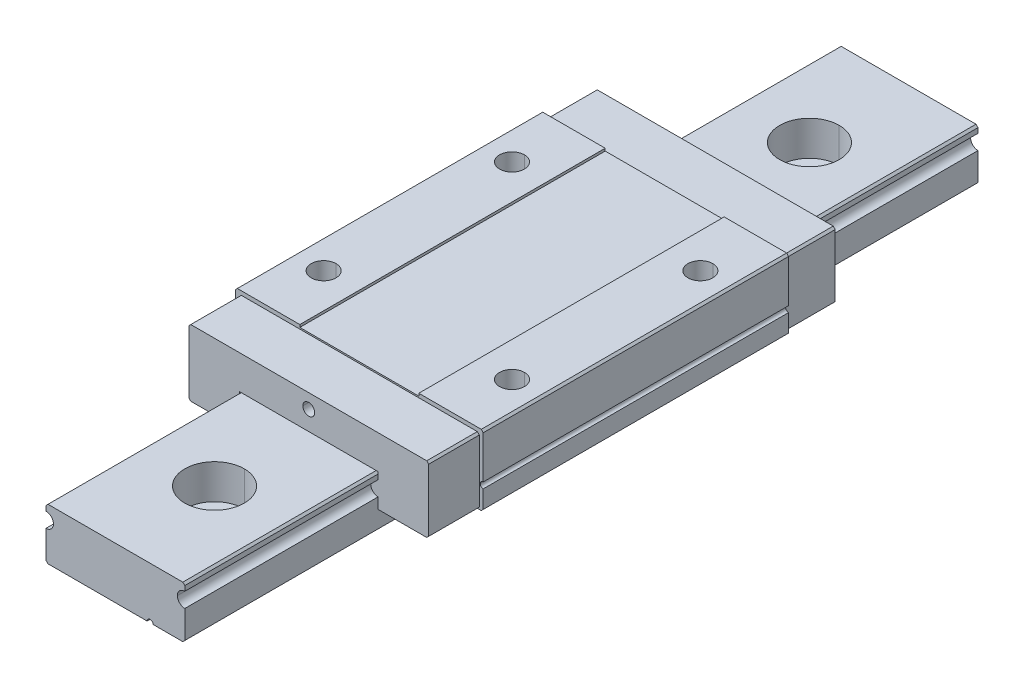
ISO-10303-21;
HEADER;
FILE_DESCRIPTION(('STEP AP214'),'2;1');
FILE_NAME('part.step','',(''),(''),'','','');
FILE_SCHEMA(('AUTOMOTIVE_DESIGN { 1 0 10303 214 1 1 1 1 }'));
ENDSEC;
DATA;
#1=APPLICATION_CONTEXT('core data for automotive mechanical design processes');
#2=APPLICATION_PROTOCOL_DEFINITION('international standard','automotive_design',2000,#1);
#3=PRODUCT_CONTEXT('',#1,'mechanical');
#4=PRODUCT('Part','Part','',(#3));
#5=PRODUCT_RELATED_PRODUCT_CATEGORY('part','',(#4));
#6=PRODUCT_DEFINITION_FORMATION('','',#4);
#7=PRODUCT_DEFINITION_CONTEXT('part definition',#1,'design');
#8=PRODUCT_DEFINITION('design','',#6,#7);
#9=PRODUCT_DEFINITION_SHAPE('','',#8);
#10=(LENGTH_UNIT() NAMED_UNIT(*) SI_UNIT(.MILLI.,.METRE.));
#11=(NAMED_UNIT(*) PLANE_ANGLE_UNIT() SI_UNIT($,.RADIAN.));
#12=(NAMED_UNIT(*) SI_UNIT($,.STERADIAN.) SOLID_ANGLE_UNIT());
#13=UNCERTAINTY_MEASURE_WITH_UNIT(LENGTH_MEASURE(1.E-05),#10,'distance_accuracy_value','');
#14=(GEOMETRIC_REPRESENTATION_CONTEXT(3) GLOBAL_UNCERTAINTY_ASSIGNED_CONTEXT((#13)) GLOBAL_UNIT_ASSIGNED_CONTEXT((#10,
#11,#12)) REPRESENTATION_CONTEXT('',''));
#15=CARTESIAN_POINT('',(0.,0.,0.));
#16=DIRECTION('',(0.,0.,1.));
#17=DIRECTION('',(1.,0.,0.));
#18=AXIS2_PLACEMENT_3D('',#15,#16,#17);
#19=CARTESIAN_POINT('',(-9.5,9.,9.5));
#20=DIRECTION('',(0.,1.,0.));
#21=DIRECTION('',(0.,0.,1.));
#22=AXIS2_PLACEMENT_3D('',#19,#20,#21);
#23=CYLINDRICAL_SURFACE('',#22,1.25);
#24=CARTESIAN_POINT('',(-9.5,6.,9.5));
#25=DIRECTION('',(0.,1.,0.));
#26=DIRECTION('',(0.,0.,1.));
#27=AXIS2_PLACEMENT_3D('',#24,#25,#26);
#28=CIRCLE('',#27,1.25);
#29=CARTESIAN_POINT('',(-9.5,6.,8.25));
#30=VERTEX_POINT('',#29);
#31=CARTESIAN_POINT('',(-9.5,6.,10.75));
#32=VERTEX_POINT('',#31);
#33=EDGE_CURVE('P0_E10',#30,#32,#28,.T.);
#34=ORIENTED_EDGE('',*,*,#33,.F.);
#35=DIRECTION('',(0.,1.,0.));
#36=VECTOR('',#35,1.);
#37=CARTESIAN_POINT('',(-9.5,9.,8.25));
#38=LINE('',#37,#36);
#39=CARTESIAN_POINT('',(-9.5,9.,8.25));
#40=VERTEX_POINT('',#39);
#41=EDGE_CURVE('P0_E1192',#30,#40,#38,.T.);
#42=ORIENTED_EDGE('',*,*,#41,.T.);
#43=CARTESIAN_POINT('',(-9.5,9.,9.5));
#44=DIRECTION('',(0.,1.,0.));
#45=DIRECTION('',(0.,0.,1.));
#46=AXIS2_PLACEMENT_3D('',#43,#44,#45);
#47=CIRCLE('',#46,1.25);
#48=CARTESIAN_POINT('',(-9.5,9.,10.75));
#49=VERTEX_POINT('',#48);
#50=EDGE_CURVE('P0_E776',#40,#49,#47,.T.);
#51=ORIENTED_EDGE('',*,*,#50,.T.);
#52=DIRECTION('',(0.,1.,0.));
#53=VECTOR('',#52,1.);
#54=CARTESIAN_POINT('',(-9.5,9.,10.75));
#55=LINE('',#54,#53);
#56=EDGE_CURVE('P0_E1134',#32,#49,#55,.T.);
#57=ORIENTED_EDGE('',*,*,#56,.F.);
#58=EDGE_LOOP('',(#34,#42,#51,#57));
#59=FACE_BOUND('',#58,.T.);
#60=ADVANCED_FACE('P0_F16',(#59),#23,.F.);
#61=CARTESIAN_POINT('',(-9.5,6.,9.5));
#62=DIRECTION('',(0.,1.,0.));
#63=DIRECTION('',(0.,0.,1.));
#64=AXIS2_PLACEMENT_3D('',#61,#62,#63);
#65=CONICAL_SURFACE('',#64,1.25,1.02974425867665);
#66=DIRECTION('',(0.,0.515038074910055,0.857167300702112));
#67=VECTOR('',#66,1.);
#68=CARTESIAN_POINT('',(-9.5,6.,10.75));
#69=LINE('',#68,#67);
#70=CARTESIAN_POINT('',(-9.5,5.24892422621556,9.5));
#71=VERTEX_POINT('',#70);
#72=EDGE_CURVE('P0_E1037',#71,#32,#69,.T.);
#73=ORIENTED_EDGE('',*,*,#72,.F.);
#74=DIRECTION('',(0.,0.515038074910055,-0.857167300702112));
#75=VECTOR('',#74,1.);
#76=CARTESIAN_POINT('',(-9.5,6.,8.25));
#77=LINE('',#76,#75);
#78=EDGE_CURVE('P0_E1042',#71,#30,#77,.T.);
#79=ORIENTED_EDGE('',*,*,#78,.T.);
#80=ORIENTED_EDGE('',*,*,#33,.T.);
#81=EDGE_LOOP('',(#73,#79,#80));
#82=FACE_BOUND('',#81,.T.);
#83=ADVANCED_FACE('P0_F1181',(#82),#65,.F.);
#84=CARTESIAN_POINT('',(-9.5,9.,-9.5));
#85=DIRECTION('',(0.,1.,0.));
#86=DIRECTION('',(0.,0.,1.));
#87=AXIS2_PLACEMENT_3D('',#84,#85,#86);
#88=CYLINDRICAL_SURFACE('',#87,1.25);
#89=CARTESIAN_POINT('',(-9.5,6.,-9.5));
#90=DIRECTION('',(0.,1.,0.));
#91=DIRECTION('',(0.,0.,1.));
#92=AXIS2_PLACEMENT_3D('',#89,#90,#91);
#93=CIRCLE('',#92,1.25);
#94=CARTESIAN_POINT('',(-9.5,6.,-10.75));
#95=VERTEX_POINT('',#94);
#96=CARTESIAN_POINT('',(-9.5,6.,-8.25));
#97=VERTEX_POINT('',#96);
#98=EDGE_CURVE('P0_E24',#95,#97,#93,.T.);
#99=ORIENTED_EDGE('',*,*,#98,.F.);
#100=DIRECTION('',(0.,1.,0.));
#101=VECTOR('',#100,1.);
#102=CARTESIAN_POINT('',(-9.5,9.,-10.75));
#103=LINE('',#102,#101);
#104=CARTESIAN_POINT('',(-9.5,9.,-10.75));
#105=VERTEX_POINT('',#104);
#106=EDGE_CURVE('P0_E1041',#95,#105,#103,.T.);
#107=ORIENTED_EDGE('',*,*,#106,.T.);
#108=CARTESIAN_POINT('',(-9.5,9.,-9.5));
#109=DIRECTION('',(0.,1.,0.));
#110=DIRECTION('',(0.,0.,1.));
#111=AXIS2_PLACEMENT_3D('',#108,#109,#110);
#112=CIRCLE('',#111,1.25);
#113=CARTESIAN_POINT('',(-9.5,9.,-8.25));
#114=VERTEX_POINT('',#113);
#115=EDGE_CURVE('P0_E761',#105,#114,#112,.T.);
#116=ORIENTED_EDGE('',*,*,#115,.T.);
#117=DIRECTION('',(0.,1.,0.));
#118=VECTOR('',#117,1.);
#119=CARTESIAN_POINT('',(-9.5,9.,-8.25));
#120=LINE('',#119,#118);
#121=EDGE_CURVE('P0_E1032',#97,#114,#120,.T.);
#122=ORIENTED_EDGE('',*,*,#121,.F.);
#123=EDGE_LOOP('',(#99,#107,#116,#122));
#124=FACE_BOUND('',#123,.T.);
#125=ADVANCED_FACE('P0_F1186',(#124),#88,.F.);
#126=CARTESIAN_POINT('',(-9.5,6.,-9.5));
#127=DIRECTION('',(0.,1.,0.));
#128=DIRECTION('',(0.,0.,1.));
#129=AXIS2_PLACEMENT_3D('',#126,#127,#128);
#130=CONICAL_SURFACE('',#129,1.25,1.02974425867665);
#131=DIRECTION('',(0.,0.515038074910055,0.857167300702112));
#132=VECTOR('',#131,1.);
#133=CARTESIAN_POINT('',(-9.5,6.,-8.25));
#134=LINE('',#133,#132);
#135=CARTESIAN_POINT('',(-9.5,5.24892422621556,-9.5));
#136=VERTEX_POINT('',#135);
#137=EDGE_CURVE('P0_E1048',#136,#97,#134,.T.);
#138=ORIENTED_EDGE('',*,*,#137,.F.);
#139=DIRECTION('',(0.,0.515038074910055,-0.857167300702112));
#140=VECTOR('',#139,1.);
#141=CARTESIAN_POINT('',(-9.5,6.,-10.75));
#142=LINE('',#141,#140);
#143=EDGE_CURVE('P0_E1062',#136,#95,#142,.T.);
#144=ORIENTED_EDGE('',*,*,#143,.T.);
#145=ORIENTED_EDGE('',*,*,#98,.T.);
#146=EDGE_LOOP('',(#138,#144,#145));
#147=FACE_BOUND('',#146,.T.);
#148=ADVANCED_FACE('P0_F1312',(#147),#130,.F.);
#149=CARTESIAN_POINT('',(9.5,9.,-9.5));
#150=DIRECTION('',(0.,1.,0.));
#151=DIRECTION('',(0.,0.,1.));
#152=AXIS2_PLACEMENT_3D('',#149,#150,#151);
#153=CYLINDRICAL_SURFACE('',#152,1.25);
#154=CARTESIAN_POINT('',(9.5,6.,-9.5));
#155=DIRECTION('',(0.,1.,0.));
#156=DIRECTION('',(0.,0.,1.));
#157=AXIS2_PLACEMENT_3D('',#154,#155,#156);
#158=CIRCLE('',#157,1.25);
#159=CARTESIAN_POINT('',(9.5,6.,-10.75));
#160=VERTEX_POINT('',#159);
#161=CARTESIAN_POINT('',(9.5,6.,-8.25));
#162=VERTEX_POINT('',#161);
#163=EDGE_CURVE('P0_E721',#160,#162,#158,.T.);
#164=ORIENTED_EDGE('',*,*,#163,.F.);
#165=DIRECTION('',(0.,1.,0.));
#166=VECTOR('',#165,1.);
#167=CARTESIAN_POINT('',(9.5,9.,-10.75));
#168=LINE('',#167,#166);
#169=CARTESIAN_POINT('',(9.5,9.,-10.75));
#170=VERTEX_POINT('',#169);
#171=EDGE_CURVE('P0_E1043',#160,#170,#168,.T.);
#172=ORIENTED_EDGE('',*,*,#171,.T.);
#173=CARTESIAN_POINT('',(9.5,9.,-9.5));
#174=DIRECTION('',(0.,1.,0.));
#175=DIRECTION('',(0.,0.,1.));
#176=AXIS2_PLACEMENT_3D('',#173,#174,#175);
#177=CIRCLE('',#176,1.25);
#178=CARTESIAN_POINT('',(9.5,9.,-8.25));
#179=VERTEX_POINT('',#178);
#180=EDGE_CURVE('P0_E808',#170,#179,#177,.T.);
#181=ORIENTED_EDGE('',*,*,#180,.T.);
#182=DIRECTION('',(0.,1.,0.));
#183=VECTOR('',#182,1.);
#184=CARTESIAN_POINT('',(9.5,9.,-8.25));
#185=LINE('',#184,#183);
#186=EDGE_CURVE('P0_E1069',#162,#179,#185,.T.);
#187=ORIENTED_EDGE('',*,*,#186,.F.);
#188=EDGE_LOOP('',(#164,#172,#181,#187));
#189=FACE_BOUND('',#188,.T.);
#190=ADVANCED_FACE('P0_F2594',(#189),#153,.F.);
#191=CARTESIAN_POINT('',(9.5,6.,-9.5));
#192=DIRECTION('',(0.,1.,0.));
#193=DIRECTION('',(0.,0.,1.));
#194=AXIS2_PLACEMENT_3D('',#191,#192,#193);
#195=CONICAL_SURFACE('',#194,1.25,1.02974425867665);
#196=DIRECTION('',(0.,0.515038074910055,0.857167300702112));
#197=VECTOR('',#196,1.);
#198=CARTESIAN_POINT('',(9.5,6.,-8.25));
#199=LINE('',#198,#197);
#200=CARTESIAN_POINT('',(9.5,5.24892422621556,-9.5));
#201=VERTEX_POINT('',#200);
#202=EDGE_CURVE('P0_E1082',#201,#162,#199,.T.);
#203=ORIENTED_EDGE('',*,*,#202,.F.);
#204=DIRECTION('',(0.,0.515038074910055,-0.857167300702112));
#205=VECTOR('',#204,1.);
#206=CARTESIAN_POINT('',(9.5,6.,-10.75));
#207=LINE('',#206,#205);
#208=EDGE_CURVE('P0_E1079',#201,#160,#207,.T.);
#209=ORIENTED_EDGE('',*,*,#208,.T.);
#210=ORIENTED_EDGE('',*,*,#163,.T.);
#211=EDGE_LOOP('',(#203,#209,#210));
#212=FACE_BOUND('',#211,.T.);
#213=ADVANCED_FACE('P0_F2598',(#212),#195,.F.);
#214=CARTESIAN_POINT('',(9.5,9.,9.5));
#215=DIRECTION('',(0.,1.,0.));
#216=DIRECTION('',(0.,0.,1.));
#217=AXIS2_PLACEMENT_3D('',#214,#215,#216);
#218=CYLINDRICAL_SURFACE('',#217,1.25);
#219=CARTESIAN_POINT('',(9.5,6.,9.5));
#220=DIRECTION('',(0.,1.,0.));
#221=DIRECTION('',(0.,0.,1.));
#222=AXIS2_PLACEMENT_3D('',#219,#220,#221);
#223=CIRCLE('',#222,1.25);
#224=CARTESIAN_POINT('',(9.5,6.,8.25));
#225=VERTEX_POINT('',#224);
#226=CARTESIAN_POINT('',(9.5,6.,10.75));
#227=VERTEX_POINT('',#226);
#228=EDGE_CURVE('P0_E719',#225,#227,#223,.T.);
#229=ORIENTED_EDGE('',*,*,#228,.F.);
#230=DIRECTION('',(0.,1.,0.));
#231=VECTOR('',#230,1.);
#232=CARTESIAN_POINT('',(9.5,9.,8.25));
#233=LINE('',#232,#231);
#234=CARTESIAN_POINT('',(9.5,9.,8.25));
#235=VERTEX_POINT('',#234);
#236=EDGE_CURVE('P0_E1085',#225,#235,#233,.T.);
#237=ORIENTED_EDGE('',*,*,#236,.T.);
#238=CARTESIAN_POINT('',(9.5,9.,9.5));
#239=DIRECTION('',(0.,1.,0.));
#240=DIRECTION('',(0.,0.,1.));
#241=AXIS2_PLACEMENT_3D('',#238,#239,#240);
#242=CIRCLE('',#241,1.25);
#243=CARTESIAN_POINT('',(9.5,9.,10.75));
#244=VERTEX_POINT('',#243);
#245=EDGE_CURVE('P0_E805',#235,#244,#242,.T.);
#246=ORIENTED_EDGE('',*,*,#245,.T.);
#247=DIRECTION('',(0.,1.,0.));
#248=VECTOR('',#247,1.);
#249=CARTESIAN_POINT('',(9.5,9.,10.75));
#250=LINE('',#249,#248);
#251=EDGE_CURVE('P0_E1101',#227,#244,#250,.T.);
#252=ORIENTED_EDGE('',*,*,#251,.F.);
#253=EDGE_LOOP('',(#229,#237,#246,#252));
#254=FACE_BOUND('',#253,.T.);
#255=ADVANCED_FACE('P0_F2604',(#254),#218,.F.);
#256=CARTESIAN_POINT('',(9.5,6.,9.5));
#257=DIRECTION('',(0.,1.,0.));
#258=DIRECTION('',(0.,0.,1.));
#259=AXIS2_PLACEMENT_3D('',#256,#257,#258);
#260=CONICAL_SURFACE('',#259,1.25,1.02974425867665);
#261=DIRECTION('',(0.,0.515038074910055,0.857167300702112));
#262=VECTOR('',#261,1.);
#263=CARTESIAN_POINT('',(9.5,6.,10.75));
#264=LINE('',#263,#262);
#265=CARTESIAN_POINT('',(9.5,5.24892422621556,9.5));
#266=VERTEX_POINT('',#265);
#267=EDGE_CURVE('P0_E1113',#266,#227,#264,.T.);
#268=ORIENTED_EDGE('',*,*,#267,.F.);
#269=DIRECTION('',(0.,0.515038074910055,-0.857167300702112));
#270=VECTOR('',#269,1.);
#271=CARTESIAN_POINT('',(9.5,6.,8.25));
#272=LINE('',#271,#270);
#273=EDGE_CURVE('P0_E1109',#266,#225,#272,.T.);
#274=ORIENTED_EDGE('',*,*,#273,.T.);
#275=ORIENTED_EDGE('',*,*,#228,.T.);
#276=EDGE_LOOP('',(#268,#274,#275));
#277=FACE_BOUND('',#276,.T.);
#278=ADVANCED_FACE('P0_F2607',(#277),#260,.F.);
#279=CARTESIAN_POINT('',(7.,3.75,40.));
#280=DIRECTION('',(0.,0.,-1.));
#281=DIRECTION('',(-1.,0.,0.));
#282=AXIS2_PLACEMENT_3D('',#279,#280,#281);
#283=CYLINDRICAL_SURFACE('',#282,0.75);
#284=CARTESIAN_POINT('',(7.,3.75,20.5));
#285=DIRECTION('',(0.,0.,1.));
#286=DIRECTION('',(-1.,0.,0.));
#287=AXIS2_PLACEMENT_3D('',#284,#285,#286);
#288=CIRCLE('',#287,0.75);
#289=CARTESIAN_POINT('',(6.25,3.75,20.5));
#290=VERTEX_POINT('',#289);
#291=CARTESIAN_POINT('',(7.,3.,20.5));
#292=VERTEX_POINT('',#291);
#293=EDGE_CURVE('P0_E520',#290,#292,#288,.T.);
#294=ORIENTED_EDGE('',*,*,#293,.F.);
#295=DIRECTION('',(0.,0.,-1.));
#296=VECTOR('',#295,1.);
#297=CARTESIAN_POINT('',(6.25,3.75,40.));
#298=LINE('',#297,#296);
#299=CARTESIAN_POINT('',(6.25,3.75,-20.5));
#300=VERTEX_POINT('',#299);
#301=EDGE_CURVE('P0_E672',#290,#300,#298,.T.);
#302=ORIENTED_EDGE('',*,*,#301,.T.);
#303=CARTESIAN_POINT('',(7.,3.75,-20.5));
#304=DIRECTION('',(0.,0.,1.));
#305=DIRECTION('',(-1.,0.,0.));
#306=AXIS2_PLACEMENT_3D('',#303,#304,#305);
#307=CIRCLE('',#306,0.75);
#308=CARTESIAN_POINT('',(7.,3.,-20.5));
#309=VERTEX_POINT('',#308);
#310=EDGE_CURVE('P0_E704',#300,#309,#307,.T.);
#311=ORIENTED_EDGE('',*,*,#310,.T.);
#312=DIRECTION('',(0.,0.,1.));
#313=VECTOR('',#312,1.);
#314=CARTESIAN_POINT('',(7.,3.,40.));
#315=LINE('',#314,#313);
#316=EDGE_CURVE('P0_E494',#309,#292,#315,.T.);
#317=ORIENTED_EDGE('',*,*,#316,.T.);
#318=EDGE_LOOP('',(#294,#302,#311,#317));
#319=FACE_BOUND('',#318,.T.);
#320=ADVANCED_FACE('P0_F1244',(#319),#283,.T.);
#321=CARTESIAN_POINT('',(0.,7.15,-20.5));
#322=DIRECTION('',(0.,0.,1.));
#323=DIRECTION('',(1.,0.,0.));
#324=AXIS2_PLACEMENT_3D('',#321,#322,#323);
#325=CYLINDRICAL_SURFACE('',#324,0.6);
#326=CARTESIAN_POINT('',(0.,7.15,-20.5));
#327=DIRECTION('',(0.,0.,-1.));
#328=DIRECTION('',(1.,0.,0.));
#329=AXIS2_PLACEMENT_3D('',#326,#327,#328);
#330=CIRCLE('',#329,0.6);
#331=CARTESIAN_POINT('',(0.6,7.15,-20.5));
#332=VERTEX_POINT('',#331);
#333=CARTESIAN_POINT('',(-0.6,7.15,-20.5));
#334=VERTEX_POINT('',#333);
#335=EDGE_CURVE('P0_E625',#332,#334,#330,.T.);
#336=ORIENTED_EDGE('',*,*,#335,.T.);
#337=DIRECTION('',(0.,0.,1.));
#338=VECTOR('',#337,1.);
#339=CARTESIAN_POINT('',(-0.6,7.15,-20.5));
#340=LINE('',#339,#338);
#341=CARTESIAN_POINT('',(-0.6000000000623,7.15,-15.5));
#342=VERTEX_POINT('',#341);
#343=EDGE_CURVE('P0_E660',#334,#342,#340,.T.);
#344=ORIENTED_EDGE('',*,*,#343,.T.);
#345=CARTESIAN_POINT('',(0.,7.15,-15.5));
#346=DIRECTION('',(0.,0.,-1.));
#347=DIRECTION('',(1.,0.,0.));
#348=AXIS2_PLACEMENT_3D('',#345,#346,#347);
#349=CIRCLE('',#348,0.6);
#350=CARTESIAN_POINT('',(0.600000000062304,7.15,-15.5));
#351=VERTEX_POINT('',#350);
#352=EDGE_CURVE('P0_E716',#351,#342,#349,.T.);
#353=ORIENTED_EDGE('',*,*,#352,.F.);
#354=DIRECTION('',(0.,0.,1.));
#355=VECTOR('',#354,1.);
#356=CARTESIAN_POINT('',(0.6,7.15,-20.5));
#357=LINE('',#356,#355);
#358=EDGE_CURVE('P0_E668',#332,#351,#357,.T.);
#359=ORIENTED_EDGE('',*,*,#358,.F.);
#360=EDGE_LOOP('',(#336,#344,#353,#359));
#361=FACE_BOUND('',#360,.T.);
#362=ADVANCED_FACE('P0_F1295',(#361),#325,.F.);
#363=CARTESIAN_POINT('',(0.,7.15,20.5));
#364=DIRECTION('',(0.,0.,-1.));
#365=DIRECTION('',(-1.,0.,0.));
#366=AXIS2_PLACEMENT_3D('',#363,#364,#365);
#367=CYLINDRICAL_SURFACE('',#366,0.6);
#368=CARTESIAN_POINT('',(0.,7.15,20.5));
#369=DIRECTION('',(0.,0.,-1.));
#370=DIRECTION('',(-1.,0.,0.));
#371=AXIS2_PLACEMENT_3D('',#368,#369,#370);
#372=CIRCLE('',#371,0.6);
#373=CARTESIAN_POINT('',(0.6,7.15,20.5));
#374=VERTEX_POINT('',#373);
#375=CARTESIAN_POINT('',(-0.6,7.15,20.5));
#376=VERTEX_POINT('',#375);
#377=EDGE_CURVE('P0_E696',#374,#376,#372,.T.);
#378=ORIENTED_EDGE('',*,*,#377,.F.);
#379=DIRECTION('',(0.,0.,-1.));
#380=VECTOR('',#379,1.);
#381=CARTESIAN_POINT('',(0.6,7.15,20.5));
#382=LINE('',#381,#380);
#383=CARTESIAN_POINT('',(0.599999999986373,7.15,15.5));
#384=VERTEX_POINT('',#383);
#385=EDGE_CURVE('P0_E617',#374,#384,#382,.T.);
#386=ORIENTED_EDGE('',*,*,#385,.T.);
#387=CARTESIAN_POINT('',(0.,7.15,15.5));
#388=DIRECTION('',(0.,0.,1.));
#389=DIRECTION('',(-1.,0.,0.));
#390=AXIS2_PLACEMENT_3D('',#387,#388,#389);
#391=CIRCLE('',#390,0.6);
#392=CARTESIAN_POINT('',(-0.599999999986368,7.15,15.5));
#393=VERTEX_POINT('',#392);
#394=EDGE_CURVE('P0_E624',#393,#384,#391,.T.);
#395=ORIENTED_EDGE('',*,*,#394,.F.);
#396=DIRECTION('',(0.,0.,-1.));
#397=VECTOR('',#396,1.);
#398=CARTESIAN_POINT('',(-0.6,7.15,20.5));
#399=LINE('',#398,#397);
#400=EDGE_CURVE('P0_E629',#376,#393,#399,.T.);
#401=ORIENTED_EDGE('',*,*,#400,.F.);
#402=EDGE_LOOP('',(#378,#386,#395,#401));
#403=FACE_BOUND('',#402,.T.);
#404=ADVANCED_FACE('P0_F1158',(#403),#367,.F.);
#405=CARTESIAN_POINT('',(0.,7.15,-15.4999999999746));
#406=DIRECTION('',(0.,0.,-1.));
#407=DIRECTION('',(-1.,0.,0.));
#408=AXIS2_PLACEMENT_3D('',#405,#406,#407);
#409=CONICAL_SURFACE('',#408,0.60000000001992,1.02974425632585);
#410=DIRECTION('',(-0.857167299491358,0.,-0.515038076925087));
#411=VECTOR('',#410,1.);
#412=CARTESIAN_POINT('',(-0.600000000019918,7.15,-15.4999999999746));
#413=LINE('',#412,#411);
#414=CARTESIAN_POINT('',(0.,7.15,-15.1394836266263));
#415=VERTEX_POINT('',#414);
#416=EDGE_CURVE('P0_E590',#415,#342,#413,.T.);
#417=ORIENTED_EDGE('',*,*,#416,.F.);
#418=DIRECTION('',(0.857167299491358,0.,-0.515038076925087));
#419=VECTOR('',#418,1.);
#420=CARTESIAN_POINT('',(0.600000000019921,7.15,-15.4999999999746));
#421=LINE('',#420,#419);
#422=EDGE_CURVE('P0_E586',#415,#351,#421,.T.);
#423=ORIENTED_EDGE('',*,*,#422,.T.);
#424=ORIENTED_EDGE('',*,*,#352,.T.);
#425=EDGE_LOOP('',(#417,#423,#424));
#426=FACE_BOUND('',#425,.T.);
#427=ADVANCED_FACE('P0_F1168',(#426),#409,.F.);
#428=CARTESIAN_POINT('',(0.,7.15,15.4999999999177));
#429=DIRECTION('',(0.,0.,1.));
#430=DIRECTION('',(1.,0.,0.));
#431=AXIS2_PLACEMENT_3D('',#428,#429,#430);
#432=CONICAL_SURFACE('',#431,0.599999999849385,1.02974425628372);
#433=DIRECTION('',(0.857167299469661,0.,0.515038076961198));
#434=VECTOR('',#433,1.);
#435=CARTESIAN_POINT('',(0.599999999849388,7.15,15.4999999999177));
#436=LINE('',#435,#434);
#437=CARTESIAN_POINT('',(0.,7.15,15.1394836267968));
#438=VERTEX_POINT('',#437);
#439=EDGE_CURVE('P0_E866',#438,#384,#436,.T.);
#440=ORIENTED_EDGE('',*,*,#439,.F.);
#441=DIRECTION('',(-0.857167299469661,0.,0.515038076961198));
#442=VECTOR('',#441,1.);
#443=CARTESIAN_POINT('',(-0.599999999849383,7.15,15.4999999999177));
#444=LINE('',#443,#442);
#445=EDGE_CURVE('P0_E527',#438,#393,#444,.T.);
#446=ORIENTED_EDGE('',*,*,#445,.T.);
#447=ORIENTED_EDGE('',*,*,#394,.T.);
#448=EDGE_LOOP('',(#440,#446,#447));
#449=FACE_BOUND('',#448,.T.);
#450=ADVANCED_FACE('P0_F1166',(#449),#432,.F.);
#451=CARTESIAN_POINT('',(12.5,4.2,20.5));
#452=DIRECTION('',(0.,0.,-1.));
#453=DIRECTION('',(-1.,0.,0.));
#454=AXIS2_PLACEMENT_3D('',#451,#452,#453);
#455=CYLINDRICAL_SURFACE('',#454,0.3);
#456=CARTESIAN_POINT('',(12.5,4.2,15.4));
#457=DIRECTION('',(0.,0.,-1.));
#458=DIRECTION('',(-1.,0.,0.));
#459=AXIS2_PLACEMENT_3D('',#456,#457,#458);
#460=CIRCLE('',#459,0.3);
#461=CARTESIAN_POINT('',(12.2,4.2,15.4));
#462=VERTEX_POINT('',#461);
#463=CARTESIAN_POINT('',(12.5,4.5,15.4));
#464=VERTEX_POINT('',#463);
#465=EDGE_CURVE('P0_E504',#462,#464,#460,.T.);
#466=ORIENTED_EDGE('',*,*,#465,.F.);
#467=DIRECTION('',(0.,0.,-1.));
#468=VECTOR('',#467,1.);
#469=CARTESIAN_POINT('',(12.2,4.2,20.5));
#470=LINE('',#469,#468);
#471=CARTESIAN_POINT('',(12.2,4.2,-15.4));
#472=VERTEX_POINT('',#471);
#473=EDGE_CURVE('P0_E901',#462,#472,#470,.T.);
#474=ORIENTED_EDGE('',*,*,#473,.T.);
#475=CARTESIAN_POINT('',(12.5,4.2,-15.4));
#476=DIRECTION('',(0.,0.,1.));
#477=DIRECTION('',(-1.,0.,0.));
#478=AXIS2_PLACEMENT_3D('',#475,#476,#477);
#479=CIRCLE('',#478,0.3);
#480=CARTESIAN_POINT('',(12.5,4.5,-15.4));
#481=VERTEX_POINT('',#480);
#482=EDGE_CURVE('P0_E606',#481,#472,#479,.T.);
#483=ORIENTED_EDGE('',*,*,#482,.F.);
#484=DIRECTION('',(0.,0.,-1.));
#485=VECTOR('',#484,1.);
#486=CARTESIAN_POINT('',(12.5,4.5,20.5));
#487=LINE('',#486,#485);
#488=EDGE_CURVE('P0_E828',#464,#481,#487,.T.);
#489=ORIENTED_EDGE('',*,*,#488,.F.);
#490=EDGE_LOOP('',(#466,#474,#483,#489));
#491=FACE_BOUND('',#490,.T.);
#492=ADVANCED_FACE('P0_F917',(#491),#455,.F.);
#493=CARTESIAN_POINT('',(7.,5.2,40.));
#494=DIRECTION('',(0.,-1.,0.));
#495=DIRECTION('',(0.,0.,-1.));
#496=AXIS2_PLACEMENT_3D('',#493,#494,#495);
#497=PLANE('',#496);
#498=DIRECTION('',(1.,0.,0.));
#499=VECTOR('',#498,1.);
#500=CARTESIAN_POINT('',(7.,5.2,-20.5));
#501=LINE('',#500,#499);
#502=CARTESIAN_POINT('',(-7.,5.2,-20.5));
#503=VERTEX_POINT('',#502);
#504=CARTESIAN_POINT('',(7.,5.2,-20.5));
#505=VERTEX_POINT('',#504);
#506=EDGE_CURVE('P0_E47',#503,#505,#501,.T.);
#507=ORIENTED_EDGE('',*,*,#506,.T.);
#508=DIRECTION('',(0.,0.,1.));
#509=VECTOR('',#508,1.);
#510=CARTESIAN_POINT('',(7.,5.2,40.));
#511=LINE('',#510,#509);
#512=CARTESIAN_POINT('',(7.,5.2,20.5));
#513=VERTEX_POINT('',#512);
#514=EDGE_CURVE('P0_E37',#505,#513,#511,.T.);
#515=ORIENTED_EDGE('',*,*,#514,.T.);
#516=DIRECTION('',(-1.,0.,0.));
#517=VECTOR('',#516,1.);
#518=CARTESIAN_POINT('',(7.,5.2,20.5));
#519=LINE('',#518,#517);
#520=CARTESIAN_POINT('',(-7.,5.2,20.5));
#521=VERTEX_POINT('',#520);
#522=EDGE_CURVE('P0_E689',#513,#521,#519,.T.);
#523=ORIENTED_EDGE('',*,*,#522,.T.);
#524=DIRECTION('',(0.,0.,-1.));
#525=VECTOR('',#524,1.);
#526=CARTESIAN_POINT('',(-7.,5.2,40.));
#527=LINE('',#526,#525);
#528=EDGE_CURVE('P0_E701',#521,#503,#527,.T.);
#529=ORIENTED_EDGE('',*,*,#528,.T.);
#530=EDGE_LOOP('',(#507,#515,#523,#529));
#531=FACE_BOUND('',#530,.T.);
#532=ADVANCED_FACE('P0_F1175',(#531),#497,.T.);
#533=CARTESIAN_POINT('',(7.,4.5,40.));
#534=DIRECTION('',(-1.,0.,0.));
#535=DIRECTION('',(0.,1.,0.));
#536=AXIS2_PLACEMENT_3D('',#533,#534,#535);
#537=PLANE('',#536);
#538=DIRECTION('',(0.,-1.,0.));
#539=VECTOR('',#538,1.);
#540=CARTESIAN_POINT('',(7.,4.5,-20.5));
#541=LINE('',#540,#539);
#542=CARTESIAN_POINT('',(7.,4.5,-20.5));
#543=VERTEX_POINT('',#542);
#544=EDGE_CURVE('P0_E707',#505,#543,#541,.T.);
#545=ORIENTED_EDGE('',*,*,#544,.T.);
#546=DIRECTION('',(0.,0.,1.));
#547=VECTOR('',#546,1.);
#548=CARTESIAN_POINT('',(7.,4.5,40.));
#549=LINE('',#548,#547);
#550=CARTESIAN_POINT('',(7.,4.5,20.5));
#551=VERTEX_POINT('',#550);
#552=EDGE_CURVE('P0_E680',#543,#551,#549,.T.);
#553=ORIENTED_EDGE('',*,*,#552,.T.);
#554=DIRECTION('',(0.,1.,0.));
#555=VECTOR('',#554,1.);
#556=CARTESIAN_POINT('',(7.,4.5,20.5));
#557=LINE('',#556,#555);
#558=EDGE_CURVE('P0_E693',#551,#513,#557,.T.);
#559=ORIENTED_EDGE('',*,*,#558,.T.);
#560=ORIENTED_EDGE('',*,*,#514,.F.);
#561=EDGE_LOOP('',(#545,#553,#559,#560));
#562=FACE_BOUND('',#561,.T.);
#563=ADVANCED_FACE('P0_F1235',(#562),#537,.T.);
#564=CARTESIAN_POINT('',(12.5,4.2,-20.5));
#565=DIRECTION('',(0.,0.,1.));
#566=DIRECTION('',(1.,0.,0.));
#567=AXIS2_PLACEMENT_3D('',#564,#565,#566);
#568=PLANE('',#567);
#569=ORIENTED_EDGE('',*,*,#335,.F.);
#570=CARTESIAN_POINT('',(0.,7.15,-20.5));
#571=DIRECTION('',(0.,0.,-1.));
#572=DIRECTION('',(1.,0.,0.));
#573=AXIS2_PLACEMENT_3D('',#570,#571,#572);
#574=CIRCLE('',#573,0.6);
#575=EDGE_CURVE('P0_E664',#334,#332,#574,.T.);
#576=ORIENTED_EDGE('',*,*,#575,.F.);
#577=EDGE_LOOP('',(#569,#576));
#578=FACE_BOUND('',#577,.T.);
#579=DIRECTION('',(-1.,0.,0.));
#580=VECTOR('',#579,1.);
#581=CARTESIAN_POINT('',(12.5,8.6,-20.5));
#582=LINE('',#581,#580);
#583=CARTESIAN_POINT('',(11.9,8.6,-20.5));
#584=VERTEX_POINT('',#583);
#585=CARTESIAN_POINT('',(-11.9,8.6,-20.5));
#586=VERTEX_POINT('',#585);
#587=EDGE_CURVE('P0_E657',#584,#586,#582,.T.);
#588=ORIENTED_EDGE('',*,*,#587,.F.);
#589=DIRECTION('',(0.707106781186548,-0.707106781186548,0.));
#590=VECTOR('',#589,1.);
#591=CARTESIAN_POINT('',(12.1,8.4,-20.5));
#592=LINE('',#591,#590);
#593=CARTESIAN_POINT('',(12.1,8.4,-20.5));
#594=VERTEX_POINT('',#593);
#595=EDGE_CURVE('P0_E607',#584,#594,#592,.T.);
#596=ORIENTED_EDGE('',*,*,#595,.T.);
#597=DIRECTION('',(0.,1.,0.));
#598=VECTOR('',#597,1.);
#599=CARTESIAN_POINT('',(12.1,4.2,-20.5));
#600=LINE('',#599,#598);
#601=CARTESIAN_POINT('',(12.1,2.1,-20.5));
#602=VERTEX_POINT('',#601);
#603=EDGE_CURVE('P0_E654',#602,#594,#600,.T.);
#604=ORIENTED_EDGE('',*,*,#603,.F.);
#605=DIRECTION('',(-0.707106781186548,-0.707106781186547,0.));
#606=VECTOR('',#605,1.);
#607=CARTESIAN_POINT('',(11.9,1.9,-20.5));
#608=LINE('',#607,#606);
#609=CARTESIAN_POINT('',(11.9,1.9,-20.5));
#610=VERTEX_POINT('',#609);
#611=EDGE_CURVE('P0_E585',#602,#610,#608,.T.);
#612=ORIENTED_EDGE('',*,*,#611,.T.);
#613=DIRECTION('',(1.,0.,0.));
#614=VECTOR('',#613,1.);
#615=CARTESIAN_POINT('',(12.5,1.9,-20.5));
#616=LINE('',#615,#614);
#617=CARTESIAN_POINT('',(7.,1.9,-20.5));
#618=VERTEX_POINT('',#617);
#619=EDGE_CURVE('P0_E651',#618,#610,#616,.T.);
#620=ORIENTED_EDGE('',*,*,#619,.F.);
#621=DIRECTION('',(0.,-1.,0.));
#622=VECTOR('',#621,1.);
#623=CARTESIAN_POINT('',(7.,0.,-20.5));
#624=LINE('',#623,#622);
#625=EDGE_CURVE('P0_E569',#309,#618,#624,.T.);
#626=ORIENTED_EDGE('',*,*,#625,.F.);
#627=ORIENTED_EDGE('',*,*,#310,.F.);
#628=CARTESIAN_POINT('',(7.,3.75,-20.5));
#629=DIRECTION('',(0.,0.,1.));
#630=DIRECTION('',(-1.,0.,0.));
#631=AXIS2_PLACEMENT_3D('',#628,#629,#630);
#632=CIRCLE('',#631,0.75);
#633=EDGE_CURVE('P0_E524',#543,#300,#632,.T.);
#634=ORIENTED_EDGE('',*,*,#633,.F.);
#635=ORIENTED_EDGE('',*,*,#544,.F.);
#636=ORIENTED_EDGE('',*,*,#506,.F.);
#637=DIRECTION('',(0.,1.,0.));
#638=VECTOR('',#637,1.);
#639=CARTESIAN_POINT('',(-7.,4.2,-20.5));
#640=LINE('',#639,#638);
#641=CARTESIAN_POINT('',(-7.,4.5,-20.5));
#642=VERTEX_POINT('',#641);
#643=EDGE_CURVE('P0_E697',#642,#503,#640,.T.);
#644=ORIENTED_EDGE('',*,*,#643,.F.);
#645=CARTESIAN_POINT('',(-7.,3.75,-20.5));
#646=DIRECTION('',(0.,0.,1.));
#647=DIRECTION('',(-1.,0.,0.));
#648=AXIS2_PLACEMENT_3D('',#645,#646,#647);
#649=CIRCLE('',#648,0.75);
#650=CARTESIAN_POINT('',(-7.,3.,-20.5));
#651=VERTEX_POINT('',#650);
#652=EDGE_CURVE('P0_E639',#651,#642,#649,.T.);
#653=ORIENTED_EDGE('',*,*,#652,.F.);
#654=DIRECTION('',(0.,1.,0.));
#655=VECTOR('',#654,1.);
#656=CARTESIAN_POINT('',(-7.,3.,-20.5));
#657=LINE('',#656,#655);
#658=CARTESIAN_POINT('',(-7.,1.9,-20.5));
#659=VERTEX_POINT('',#658);
#660=EDGE_CURVE('P0_E551',#659,#651,#657,.T.);
#661=ORIENTED_EDGE('',*,*,#660,.F.);
#662=DIRECTION('',(1.,0.,0.));
#663=VECTOR('',#662,1.);
#664=CARTESIAN_POINT('',(12.5,1.9,-20.5));
#665=LINE('',#664,#663);
#666=CARTESIAN_POINT('',(-11.9,1.9,-20.5));
#667=VERTEX_POINT('',#666);
#668=EDGE_CURVE('P0_E636',#667,#659,#665,.T.);
#669=ORIENTED_EDGE('',*,*,#668,.F.);
#670=DIRECTION('',(-0.707106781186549,0.707106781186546,0.));
#671=VECTOR('',#670,1.);
#672=CARTESIAN_POINT('',(-12.1,2.1,-20.5));
#673=LINE('',#672,#671);
#674=CARTESIAN_POINT('',(-12.1,2.1,-20.5));
#675=VERTEX_POINT('',#674);
#676=EDGE_CURVE('P0_E793',#667,#675,#673,.T.);
#677=ORIENTED_EDGE('',*,*,#676,.T.);
#678=DIRECTION('',(0.,-1.,0.));
#679=VECTOR('',#678,1.);
#680=CARTESIAN_POINT('',(-12.1,4.2,-20.5));
#681=LINE('',#680,#679);
#682=CARTESIAN_POINT('',(-12.1,8.4,-20.5));
#683=VERTEX_POINT('',#682);
#684=EDGE_CURVE('P0_E630',#683,#675,#681,.T.);
#685=ORIENTED_EDGE('',*,*,#684,.F.);
#686=DIRECTION('',(0.707106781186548,0.707106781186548,0.));
#687=VECTOR('',#686,1.);
#688=CARTESIAN_POINT('',(-11.9,8.6,-20.5));
#689=LINE('',#688,#687);
#690=EDGE_CURVE('P0_E603',#683,#586,#689,.T.);
#691=ORIENTED_EDGE('',*,*,#690,.T.);
#692=EDGE_LOOP('',(#588,#596,#604,#612,#620,#626,#627,#634,#635,#636,#644,#653,#661,#669,#677,
#685,#691));
#693=FACE_BOUND('',#692,.T.);
#694=ADVANCED_FACE('P0_F1228',(#578,#693),#568,.F.);
#695=CARTESIAN_POINT('',(-7.,5.2,40.));
#696=DIRECTION('',(1.,0.,0.));
#697=DIRECTION('',(0.,-1.,0.));
#698=AXIS2_PLACEMENT_3D('',#695,#696,#697);
#699=PLANE('',#698);
#700=ORIENTED_EDGE('',*,*,#643,.T.);
#701=ORIENTED_EDGE('',*,*,#528,.F.);
#702=DIRECTION('',(0.,-1.,0.));
#703=VECTOR('',#702,1.);
#704=CARTESIAN_POINT('',(-7.,5.2,20.5));
#705=LINE('',#704,#703);
#706=CARTESIAN_POINT('',(-7.,4.5,20.5));
#707=VERTEX_POINT('',#706);
#708=EDGE_CURVE('P0_E523',#521,#707,#705,.T.);
#709=ORIENTED_EDGE('',*,*,#708,.T.);
#710=DIRECTION('',(0.,0.,-1.));
#711=VECTOR('',#710,1.);
#712=CARTESIAN_POINT('',(-7.,4.5,40.));
#713=LINE('',#712,#711);
#714=EDGE_CURVE('P0_E643',#707,#642,#713,.T.);
#715=ORIENTED_EDGE('',*,*,#714,.T.);
#716=EDGE_LOOP('',(#700,#701,#709,#715));
#717=FACE_BOUND('',#716,.T.);
#718=ADVANCED_FACE('P0_F1232',(#717),#699,.T.);
#719=CARTESIAN_POINT('',(12.5,4.2,20.5));
#720=DIRECTION('',(0.,0.,1.));
#721=DIRECTION('',(1.,0.,0.));
#722=AXIS2_PLACEMENT_3D('',#719,#720,#721);
#723=PLANE('',#722);
#724=CARTESIAN_POINT('',(0.,7.15,20.5));
#725=DIRECTION('',(0.,0.,-1.));
#726=DIRECTION('',(-1.,0.,0.));
#727=AXIS2_PLACEMENT_3D('',#724,#725,#726);
#728=CIRCLE('',#727,0.6);
#729=EDGE_CURVE('P0_E621',#376,#374,#728,.T.);
#730=ORIENTED_EDGE('',*,*,#729,.T.);
#731=ORIENTED_EDGE('',*,*,#377,.T.);
#732=EDGE_LOOP('',(#730,#731));
#733=FACE_BOUND('',#732,.T.);
#734=CARTESIAN_POINT('',(7.,3.75,20.5));
#735=DIRECTION('',(0.,0.,1.));
#736=DIRECTION('',(-1.,0.,0.));
#737=AXIS2_PLACEMENT_3D('',#734,#735,#736);
#738=CIRCLE('',#737,0.75);
#739=EDGE_CURVE('P0_E676',#551,#290,#738,.T.);
#740=ORIENTED_EDGE('',*,*,#739,.T.);
#741=ORIENTED_EDGE('',*,*,#293,.T.);
#742=DIRECTION('',(0.,1.,0.));
#743=VECTOR('',#742,1.);
#744=CARTESIAN_POINT('',(7.,0.,20.5));
#745=LINE('',#744,#743);
#746=CARTESIAN_POINT('',(7.,1.9,20.5));
#747=VERTEX_POINT('',#746);
#748=EDGE_CURVE('P0_E570',#747,#292,#745,.T.);
#749=ORIENTED_EDGE('',*,*,#748,.F.);
#750=DIRECTION('',(1.,0.,0.));
#751=VECTOR('',#750,1.);
#752=CARTESIAN_POINT('',(12.5,1.9,20.5));
#753=LINE('',#752,#751);
#754=CARTESIAN_POINT('',(11.9,1.9,20.5));
#755=VERTEX_POINT('',#754);
#756=EDGE_CURVE('P0_E648',#747,#755,#753,.T.);
#757=ORIENTED_EDGE('',*,*,#756,.T.);
#758=DIRECTION('',(-0.707106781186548,-0.707106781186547,0.));
#759=VECTOR('',#758,1.);
#760=CARTESIAN_POINT('',(12.1,2.1,20.5));
#761=LINE('',#760,#759);
#762=CARTESIAN_POINT('',(12.1,2.1,20.5));
#763=VERTEX_POINT('',#762);
#764=EDGE_CURVE('P0_E560',#763,#755,#761,.T.);
#765=ORIENTED_EDGE('',*,*,#764,.F.);
#766=DIRECTION('',(0.,1.,0.));
#767=VECTOR('',#766,1.);
#768=CARTESIAN_POINT('',(12.1,4.2,20.5));
#769=LINE('',#768,#767);
#770=CARTESIAN_POINT('',(12.1,8.4,20.5));
#771=VERTEX_POINT('',#770);
#772=EDGE_CURVE('P0_E575',#763,#771,#769,.T.);
#773=ORIENTED_EDGE('',*,*,#772,.T.);
#774=DIRECTION('',(0.707106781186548,-0.707106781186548,0.));
#775=VECTOR('',#774,1.);
#776=CARTESIAN_POINT('',(11.9,8.6,20.5));
#777=LINE('',#776,#775);
#778=CARTESIAN_POINT('',(11.9,8.6,20.5));
#779=VERTEX_POINT('',#778);
#780=EDGE_CURVE('P0_E773',#779,#771,#777,.T.);
#781=ORIENTED_EDGE('',*,*,#780,.F.);
#782=DIRECTION('',(-1.,0.,0.));
#783=VECTOR('',#782,1.);
#784=CARTESIAN_POINT('',(12.5,8.6,20.5));
#785=LINE('',#784,#783);
#786=CARTESIAN_POINT('',(-11.9,8.6,20.5));
#787=VERTEX_POINT('',#786);
#788=EDGE_CURVE('P0_E578',#779,#787,#785,.T.);
#789=ORIENTED_EDGE('',*,*,#788,.T.);
#790=DIRECTION('',(-0.707106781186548,-0.707106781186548,0.));
#791=VECTOR('',#790,1.);
#792=CARTESIAN_POINT('',(-12.1,8.4,20.5));
#793=LINE('',#792,#791);
#794=CARTESIAN_POINT('',(-12.1,8.4,20.5));
#795=VERTEX_POINT('',#794);
#796=EDGE_CURVE('P0_E799',#787,#795,#793,.T.);
#797=ORIENTED_EDGE('',*,*,#796,.T.);
#798=DIRECTION('',(0.,-1.,0.));
#799=VECTOR('',#798,1.);
#800=CARTESIAN_POINT('',(-12.1,4.2,20.5));
#801=LINE('',#800,#799);
#802=CARTESIAN_POINT('',(-12.1,2.1,20.5));
#803=VERTEX_POINT('',#802);
#804=EDGE_CURVE('P0_E616',#795,#803,#801,.T.);
#805=ORIENTED_EDGE('',*,*,#804,.T.);
#806=DIRECTION('',(0.707106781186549,-0.707106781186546,0.));
#807=VECTOR('',#806,1.);
#808=CARTESIAN_POINT('',(-11.9,1.9,20.5));
#809=LINE('',#808,#807);
#810=CARTESIAN_POINT('',(-11.9,1.9,20.5));
#811=VERTEX_POINT('',#810);
#812=EDGE_CURVE('P0_E537',#803,#811,#809,.T.);
#813=ORIENTED_EDGE('',*,*,#812,.T.);
#814=DIRECTION('',(1.,0.,0.));
#815=VECTOR('',#814,1.);
#816=CARTESIAN_POINT('',(12.5,1.9,20.5));
#817=LINE('',#816,#815);
#818=CARTESIAN_POINT('',(-7.,1.9,20.5));
#819=VERTEX_POINT('',#818);
#820=EDGE_CURVE('P0_E633',#811,#819,#817,.T.);
#821=ORIENTED_EDGE('',*,*,#820,.T.);
#822=DIRECTION('',(0.,-1.,0.));
#823=VECTOR('',#822,1.);
#824=CARTESIAN_POINT('',(-7.,3.,20.5));
#825=LINE('',#824,#823);
#826=CARTESIAN_POINT('',(-7.,3.,20.5));
#827=VERTEX_POINT('',#826);
#828=EDGE_CURVE('P0_E561',#827,#819,#825,.T.);
#829=ORIENTED_EDGE('',*,*,#828,.F.);
#830=CARTESIAN_POINT('',(-7.,3.75,20.5));
#831=DIRECTION('',(0.,0.,1.));
#832=DIRECTION('',(-1.,0.,0.));
#833=AXIS2_PLACEMENT_3D('',#830,#831,#832);
#834=CIRCLE('',#833,0.75);
#835=EDGE_CURVE('P0_E647',#827,#707,#834,.T.);
#836=ORIENTED_EDGE('',*,*,#835,.T.);
#837=ORIENTED_EDGE('',*,*,#708,.F.);
#838=ORIENTED_EDGE('',*,*,#522,.F.);
#839=ORIENTED_EDGE('',*,*,#558,.F.);
#840=EDGE_LOOP('',(#740,#741,#749,#757,#765,#773,#781,#789,#797,#805,#813,#821,#829,#836,#837,
#838,#839));
#841=FACE_BOUND('',#840,.T.);
#842=ADVANCED_FACE('P0_F1153',(#733,#841),#723,.T.);
#843=CARTESIAN_POINT('',(7.,3.75,40.));
#844=DIRECTION('',(0.,0.,-1.));
#845=DIRECTION('',(-1.,0.,0.));
#846=AXIS2_PLACEMENT_3D('',#843,#844,#845);
#847=CYLINDRICAL_SURFACE('',#846,0.75);
#848=ORIENTED_EDGE('',*,*,#301,.F.);
#849=ORIENTED_EDGE('',*,*,#739,.F.);
#850=ORIENTED_EDGE('',*,*,#552,.F.);
#851=ORIENTED_EDGE('',*,*,#633,.T.);
#852=EDGE_LOOP('',(#848,#849,#850,#851));
#853=FACE_BOUND('',#852,.T.);
#854=ADVANCED_FACE('P0_F1241',(#853),#847,.T.);
#855=CARTESIAN_POINT('',(0.,7.15,-20.5));
#856=DIRECTION('',(0.,0.,1.));
#857=DIRECTION('',(1.,0.,0.));
#858=AXIS2_PLACEMENT_3D('',#855,#856,#857);
#859=CYLINDRICAL_SURFACE('',#858,0.6);
#860=ORIENTED_EDGE('',*,*,#343,.F.);
#861=ORIENTED_EDGE('',*,*,#575,.T.);
#862=ORIENTED_EDGE('',*,*,#358,.T.);
#863=CARTESIAN_POINT('',(0.,7.15,-15.5));
#864=DIRECTION('',(0.,0.,-1.));
#865=DIRECTION('',(1.,0.,0.));
#866=AXIS2_PLACEMENT_3D('',#863,#864,#865);
#867=CIRCLE('',#866,0.6);
#868=EDGE_CURVE('P0_E579',#342,#351,#867,.T.);
#869=ORIENTED_EDGE('',*,*,#868,.F.);
#870=EDGE_LOOP('',(#860,#861,#862,#869));
#871=FACE_BOUND('',#870,.T.);
#872=ADVANCED_FACE('P0_F1302',(#871),#859,.F.);
#873=CARTESIAN_POINT('',(12.5,8.6,-20.5));
#874=DIRECTION('',(0.,1.,0.));
#875=DIRECTION('',(1.,0.,0.));
#876=AXIS2_PLACEMENT_3D('',#873,#874,#875);
#877=PLANE('',#876);
#878=DIRECTION('',(1.,0.,0.));
#879=VECTOR('',#878,1.);
#880=CARTESIAN_POINT('',(12.5,8.6,-15.4));
#881=LINE('',#880,#879);
#882=CARTESIAN_POINT('',(-11.9,8.6,-15.4));
#883=VERTEX_POINT('',#882);
#884=CARTESIAN_POINT('',(11.9,8.6,-15.4));
#885=VERTEX_POINT('',#884);
#886=EDGE_CURVE('P0_E543',#883,#885,#881,.T.);
#887=ORIENTED_EDGE('',*,*,#886,.T.);
#888=DIRECTION('',(0.,0.,-1.));
#889=VECTOR('',#888,1.);
#890=CARTESIAN_POINT('',(11.9,8.6,-20.5));
#891=LINE('',#890,#889);
#892=EDGE_CURVE('P0_E611',#885,#584,#891,.T.);
#893=ORIENTED_EDGE('',*,*,#892,.T.);
#894=ORIENTED_EDGE('',*,*,#587,.T.);
#895=DIRECTION('',(0.,0.,1.));
#896=VECTOR('',#895,1.);
#897=CARTESIAN_POINT('',(-11.9,8.6,-20.5));
#898=LINE('',#897,#896);
#899=EDGE_CURVE('P0_E825',#586,#883,#898,.T.);
#900=ORIENTED_EDGE('',*,*,#899,.T.);
#901=EDGE_LOOP('',(#887,#893,#894,#900));
#902=FACE_BOUND('',#901,.T.);
#903=ADVANCED_FACE('P0_F1299',(#902),#877,.T.);
#904=CARTESIAN_POINT('',(12.1,1.9,-20.5));
#905=DIRECTION('',(1.,0.,0.));
#906=DIRECTION('',(0.,1.,0.));
#907=AXIS2_PLACEMENT_3D('',#904,#905,#906);
#908=PLANE('',#907);
#909=DIRECTION('',(0.,-1.,0.));
#910=VECTOR('',#909,1.);
#911=CARTESIAN_POINT('',(12.1,1.9,-15.4));
#912=LINE('',#911,#910);
#913=CARTESIAN_POINT('',(12.1,8.4,-15.4));
#914=VERTEX_POINT('',#913);
#915=CARTESIAN_POINT('',(12.1,2.1,-15.4));
#916=VERTEX_POINT('',#915);
#917=EDGE_CURVE('P0_E824',#914,#916,#912,.T.);
#918=ORIENTED_EDGE('',*,*,#917,.T.);
#919=DIRECTION('',(0.,0.,-1.));
#920=VECTOR('',#919,1.);
#921=CARTESIAN_POINT('',(12.1,2.1,-20.5));
#922=LINE('',#921,#920);
#923=EDGE_CURVE('P0_E597',#916,#602,#922,.T.);
#924=ORIENTED_EDGE('',*,*,#923,.T.);
#925=ORIENTED_EDGE('',*,*,#603,.T.);
#926=DIRECTION('',(0.,0.,1.));
#927=VECTOR('',#926,1.);
#928=CARTESIAN_POINT('',(12.1,8.4,-20.5));
#929=LINE('',#928,#927);
#930=EDGE_CURVE('P0_E591',#594,#914,#929,.T.);
#931=ORIENTED_EDGE('',*,*,#930,.T.);
#932=EDGE_LOOP('',(#918,#924,#925,#931));
#933=FACE_BOUND('',#932,.T.);
#934=ADVANCED_FACE('P0_F1298',(#933),#908,.T.);
#935=CARTESIAN_POINT('',(12.5,1.9,20.5));
#936=DIRECTION('',(0.,-1.,0.));
#937=DIRECTION('',(0.,0.,-1.));
#938=AXIS2_PLACEMENT_3D('',#935,#936,#937);
#939=PLANE('',#938);
#940=DIRECTION('',(1.,0.,0.));
#941=VECTOR('',#940,1.);
#942=CARTESIAN_POINT('',(12.5,1.9,-15.4));
#943=LINE('',#942,#941);
#944=CARTESIAN_POINT('',(11.9,1.9,-15.4));
#945=VERTEX_POINT('',#944);
#946=CARTESIAN_POINT('',(12.3,1.9,-15.4));
#947=VERTEX_POINT('',#946);
#948=EDGE_CURVE('P0_E489',#945,#947,#943,.T.);
#949=ORIENTED_EDGE('',*,*,#948,.T.);
#950=DIRECTION('',(0.,0.,1.));
#951=VECTOR('',#950,1.);
#952=CARTESIAN_POINT('',(12.3,1.9,20.5));
#953=LINE('',#952,#951);
#954=CARTESIAN_POINT('',(12.3,1.9,15.4));
#955=VERTEX_POINT('',#954);
#956=EDGE_CURVE('P0_E481',#947,#955,#953,.T.);
#957=ORIENTED_EDGE('',*,*,#956,.T.);
#958=DIRECTION('',(1.,0.,0.));
#959=VECTOR('',#958,1.);
#960=CARTESIAN_POINT('',(-12.5,1.9,15.4));
#961=LINE('',#960,#959);
#962=CARTESIAN_POINT('',(11.9,1.9,15.4));
#963=VERTEX_POINT('',#962);
#964=EDGE_CURVE('P0_E486',#963,#955,#961,.T.);
#965=ORIENTED_EDGE('',*,*,#964,.F.);
#966=DIRECTION('',(0.,0.,1.));
#967=VECTOR('',#966,1.);
#968=CARTESIAN_POINT('',(11.9,1.9,20.5));
#969=LINE('',#968,#967);
#970=EDGE_CURVE('P0_E562',#963,#755,#969,.T.);
#971=ORIENTED_EDGE('',*,*,#970,.T.);
#972=ORIENTED_EDGE('',*,*,#756,.F.);
#973=DIRECTION('',(0.,0.,-1.));
#974=VECTOR('',#973,1.);
#975=CARTESIAN_POINT('',(7.,1.9,20.5));
#976=LINE('',#975,#974);
#977=EDGE_CURVE('P0_E574',#747,#618,#976,.T.);
#978=ORIENTED_EDGE('',*,*,#977,.T.);
#979=ORIENTED_EDGE('',*,*,#619,.T.);
#980=DIRECTION('',(0.,0.,1.));
#981=VECTOR('',#980,1.);
#982=CARTESIAN_POINT('',(11.9,1.9,20.5));
#983=LINE('',#982,#981);
#984=EDGE_CURVE('P0_E596',#610,#945,#983,.T.);
#985=ORIENTED_EDGE('',*,*,#984,.T.);
#986=EDGE_LOOP('',(#949,#957,#965,#971,#972,#978,#979,#985));
#987=FACE_BOUND('',#986,.T.);
#988=ADVANCED_FACE('P0_F483',(#987),#939,.T.);
#989=CARTESIAN_POINT('',(-7.,3.75,40.));
#990=DIRECTION('',(0.,0.,-1.));
#991=DIRECTION('',(-1.,0.,0.));
#992=AXIS2_PLACEMENT_3D('',#989,#990,#991);
#993=CYLINDRICAL_SURFACE('',#992,0.75);
#994=ORIENTED_EDGE('',*,*,#652,.T.);
#995=ORIENTED_EDGE('',*,*,#714,.F.);
#996=ORIENTED_EDGE('',*,*,#835,.F.);
#997=DIRECTION('',(0.,0.,-1.));
#998=VECTOR('',#997,1.);
#999=CARTESIAN_POINT('',(-7.,3.,40.));
#1000=LINE('',#999,#998);
#1001=EDGE_CURVE('P0_E555',#827,#651,#1000,.T.);
#1002=ORIENTED_EDGE('',*,*,#1001,.T.);
#1003=EDGE_LOOP('',(#994,#995,#996,#1002));
#1004=FACE_BOUND('',#1003,.T.);
#1005=ADVANCED_FACE('P0_F1230',(#1004),#993,.T.);
#1006=CARTESIAN_POINT('',(12.5,1.9,20.5));
#1007=DIRECTION('',(0.,-1.,0.));
#1008=DIRECTION('',(0.,0.,-1.));
#1009=AXIS2_PLACEMENT_3D('',#1006,#1007,#1008);
#1010=PLANE('',#1009);
#1011=ORIENTED_EDGE('',*,*,#820,.F.);
#1012=DIRECTION('',(0.,0.,-1.));
#1013=VECTOR('',#1012,1.);
#1014=CARTESIAN_POINT('',(-11.9,1.9,20.5));
#1015=LINE('',#1014,#1013);
#1016=CARTESIAN_POINT('',(-11.9,1.9,15.4));
#1017=VERTEX_POINT('',#1016);
#1018=EDGE_CURVE('P0_E548',#811,#1017,#1015,.T.);
#1019=ORIENTED_EDGE('',*,*,#1018,.T.);
#1020=DIRECTION('',(1.,0.,0.));
#1021=VECTOR('',#1020,1.);
#1022=CARTESIAN_POINT('',(-12.5,1.9,15.4));
#1023=LINE('',#1022,#1021);
#1024=CARTESIAN_POINT('',(-12.3,1.9,15.4));
#1025=VERTEX_POINT('',#1024);
#1026=EDGE_CURVE('P0_E766',#1025,#1017,#1023,.T.);
#1027=ORIENTED_EDGE('',*,*,#1026,.F.);
#1028=DIRECTION('',(0.,0.,-1.));
#1029=VECTOR('',#1028,1.);
#1030=CARTESIAN_POINT('',(-12.3,1.9,20.5));
#1031=LINE('',#1030,#1029);
#1032=CARTESIAN_POINT('',(-12.3,1.9,-15.4));
#1033=VERTEX_POINT('',#1032);
#1034=EDGE_CURVE('P0_E531',#1025,#1033,#1031,.T.);
#1035=ORIENTED_EDGE('',*,*,#1034,.T.);
#1036=DIRECTION('',(1.,0.,0.));
#1037=VECTOR('',#1036,1.);
#1038=CARTESIAN_POINT('',(12.5,1.9,-15.4));
#1039=LINE('',#1038,#1037);
#1040=CARTESIAN_POINT('',(-11.9,1.9,-15.4));
#1041=VERTEX_POINT('',#1040);
#1042=EDGE_CURVE('P0_E542',#1033,#1041,#1039,.T.);
#1043=ORIENTED_EDGE('',*,*,#1042,.T.);
#1044=DIRECTION('',(0.,0.,-1.));
#1045=VECTOR('',#1044,1.);
#1046=CARTESIAN_POINT('',(-11.9,1.9,20.5));
#1047=LINE('',#1046,#1045);
#1048=EDGE_CURVE('P0_E789',#1041,#667,#1047,.T.);
#1049=ORIENTED_EDGE('',*,*,#1048,.T.);
#1050=ORIENTED_EDGE('',*,*,#668,.T.);
#1051=DIRECTION('',(0.,0.,1.));
#1052=VECTOR('',#1051,1.);
#1053=CARTESIAN_POINT('',(-7.,1.9,20.5));
#1054=LINE('',#1053,#1052);
#1055=EDGE_CURVE('P0_E556',#659,#819,#1054,.T.);
#1056=ORIENTED_EDGE('',*,*,#1055,.T.);
#1057=EDGE_LOOP('',(#1011,#1019,#1027,#1035,#1043,#1049,#1050,#1056));
#1058=FACE_BOUND('',#1057,.T.);
#1059=ADVANCED_FACE('P0_F1225',(#1058),#1010,.T.);
#1060=CARTESIAN_POINT('',(-12.1,8.6,-20.5));
#1061=DIRECTION('',(-1.,0.,0.));
#1062=DIRECTION('',(0.,1.,0.));
#1063=AXIS2_PLACEMENT_3D('',#1060,#1061,#1062);
#1064=PLANE('',#1063);
#1065=ORIENTED_EDGE('',*,*,#684,.T.);
#1066=DIRECTION('',(0.,0.,1.));
#1067=VECTOR('',#1066,1.);
#1068=CARTESIAN_POINT('',(-12.1,2.1,-20.5));
#1069=LINE('',#1068,#1067);
#1070=CARTESIAN_POINT('',(-12.1,2.1,-15.4));
#1071=VERTEX_POINT('',#1070);
#1072=EDGE_CURVE('P0_E533',#675,#1071,#1069,.T.);
#1073=ORIENTED_EDGE('',*,*,#1072,.T.);
#1074=DIRECTION('',(0.,1.,0.));
#1075=VECTOR('',#1074,1.);
#1076=CARTESIAN_POINT('',(-12.1,8.6,-15.4));
#1077=LINE('',#1076,#1075);
#1078=CARTESIAN_POINT('',(-12.1,8.4,-15.4));
#1079=VERTEX_POINT('',#1078);
#1080=EDGE_CURVE('P0_E539',#1071,#1079,#1077,.T.);
#1081=ORIENTED_EDGE('',*,*,#1080,.T.);
#1082=DIRECTION('',(0.,0.,-1.));
#1083=VECTOR('',#1082,1.);
#1084=CARTESIAN_POINT('',(-12.1,8.4,-20.5));
#1085=LINE('',#1084,#1083);
#1086=EDGE_CURVE('P0_E598',#1079,#683,#1085,.T.);
#1087=ORIENTED_EDGE('',*,*,#1086,.T.);
#1088=EDGE_LOOP('',(#1065,#1073,#1081,#1087));
#1089=FACE_BOUND('',#1088,.T.);
#1090=ADVANCED_FACE('P0_F1283',(#1089),#1064,.T.);
#1091=CARTESIAN_POINT('',(0.,7.15,20.5));
#1092=DIRECTION('',(0.,0.,-1.));
#1093=DIRECTION('',(-1.,0.,0.));
#1094=AXIS2_PLACEMENT_3D('',#1091,#1092,#1093);
#1095=CYLINDRICAL_SURFACE('',#1094,0.6);
#1096=ORIENTED_EDGE('',*,*,#385,.F.);
#1097=ORIENTED_EDGE('',*,*,#729,.F.);
#1098=ORIENTED_EDGE('',*,*,#400,.T.);
#1099=CARTESIAN_POINT('',(0.,7.15,15.5));
#1100=DIRECTION('',(0.,0.,1.));
#1101=DIRECTION('',(-1.,0.,0.));
#1102=AXIS2_PLACEMENT_3D('',#1099,#1100,#1101);
#1103=CIRCLE('',#1102,0.6);
#1104=EDGE_CURVE('P0_E532',#384,#393,#1103,.T.);
#1105=ORIENTED_EDGE('',*,*,#1104,.F.);
#1106=EDGE_LOOP('',(#1096,#1097,#1098,#1105));
#1107=FACE_BOUND('',#1106,.T.);
#1108=ADVANCED_FACE('P0_F1161',(#1107),#1095,.F.);
#1109=CARTESIAN_POINT('',(-12.1,1.9,20.5));
#1110=DIRECTION('',(-1.,0.,0.));
#1111=DIRECTION('',(0.,1.,0.));
#1112=AXIS2_PLACEMENT_3D('',#1109,#1110,#1111);
#1113=PLANE('',#1112);
#1114=DIRECTION('',(0.,-1.,0.));
#1115=VECTOR('',#1114,1.);
#1116=CARTESIAN_POINT('',(-12.1,1.9,15.4));
#1117=LINE('',#1116,#1115);
#1118=CARTESIAN_POINT('',(-12.1,8.4,15.4));
#1119=VERTEX_POINT('',#1118);
#1120=CARTESIAN_POINT('',(-12.1,2.1,15.4));
#1121=VERTEX_POINT('',#1120);
#1122=EDGE_CURVE('P0_E829',#1119,#1121,#1117,.T.);
#1123=ORIENTED_EDGE('',*,*,#1122,.T.);
#1124=DIRECTION('',(0.,0.,1.));
#1125=VECTOR('',#1124,1.);
#1126=CARTESIAN_POINT('',(-12.1,2.1,20.5));
#1127=LINE('',#1126,#1125);
#1128=EDGE_CURVE('P0_E544',#1121,#803,#1127,.T.);
#1129=ORIENTED_EDGE('',*,*,#1128,.T.);
#1130=ORIENTED_EDGE('',*,*,#804,.F.);
#1131=DIRECTION('',(0.,0.,-1.));
#1132=VECTOR('',#1131,1.);
#1133=CARTESIAN_POINT('',(-12.1,8.4,20.5));
#1134=LINE('',#1133,#1132);
#1135=EDGE_CURVE('P0_E767',#795,#1119,#1134,.T.);
#1136=ORIENTED_EDGE('',*,*,#1135,.T.);
#1137=EDGE_LOOP('',(#1123,#1129,#1130,#1136));
#1138=FACE_BOUND('',#1137,.T.);
#1139=ADVANCED_FACE('P0_F1279',(#1138),#1113,.T.);
#1140=CARTESIAN_POINT('',(-12.5,8.6,20.5));
#1141=DIRECTION('',(0.,1.,0.));
#1142=DIRECTION('',(1.,0.,0.));
#1143=AXIS2_PLACEMENT_3D('',#1140,#1141,#1142);
#1144=PLANE('',#1143);
#1145=ORIENTED_EDGE('',*,*,#788,.F.);
#1146=DIRECTION('',(0.,0.,-1.));
#1147=VECTOR('',#1146,1.);
#1148=CARTESIAN_POINT('',(11.9,8.6,20.5));
#1149=LINE('',#1148,#1147);
#1150=CARTESIAN_POINT('',(11.9,8.6,15.4));
#1151=VERTEX_POINT('',#1150);
#1152=EDGE_CURVE('P0_E804',#779,#1151,#1149,.T.);
#1153=ORIENTED_EDGE('',*,*,#1152,.T.);
#1154=DIRECTION('',(-1.,0.,0.));
#1155=VECTOR('',#1154,1.);
#1156=CARTESIAN_POINT('',(-12.5,8.6,15.4));
#1157=LINE('',#1156,#1155);
#1158=CARTESIAN_POINT('',(-11.9,8.6,15.4));
#1159=VERTEX_POINT('',#1158);
#1160=EDGE_CURVE('P0_E833',#1151,#1159,#1157,.T.);
#1161=ORIENTED_EDGE('',*,*,#1160,.T.);
#1162=DIRECTION('',(0.,0.,1.));
#1163=VECTOR('',#1162,1.);
#1164=CARTESIAN_POINT('',(-11.9,8.6,20.5));
#1165=LINE('',#1164,#1163);
#1166=EDGE_CURVE('P0_E803',#1159,#787,#1165,.T.);
#1167=ORIENTED_EDGE('',*,*,#1166,.T.);
#1168=EDGE_LOOP('',(#1145,#1153,#1161,#1167));
#1169=FACE_BOUND('',#1168,.T.);
#1170=ADVANCED_FACE('P0_F1275',(#1169),#1144,.T.);
#1171=CARTESIAN_POINT('',(12.1,1.9,20.5));
#1172=DIRECTION('',(-1.,0.,0.));
#1173=DIRECTION('',(0.,1.,0.));
#1174=AXIS2_PLACEMENT_3D('',#1171,#1172,#1173);
#1175=PLANE('',#1174);
#1176=ORIENTED_EDGE('',*,*,#772,.F.);
#1177=DIRECTION('',(0.,0.,1.));
#1178=VECTOR('',#1177,1.);
#1179=CARTESIAN_POINT('',(12.1,2.1,20.5));
#1180=LINE('',#1179,#1178);
#1181=CARTESIAN_POINT('',(12.1,2.1,15.4));
#1182=VERTEX_POINT('',#1181);
#1183=EDGE_CURVE('P0_E565',#1182,#763,#1180,.T.);
#1184=ORIENTED_EDGE('',*,*,#1183,.F.);
#1185=DIRECTION('',(0.,-1.,0.));
#1186=VECTOR('',#1185,1.);
#1187=CARTESIAN_POINT('',(12.1,1.9,15.4));
#1188=LINE('',#1187,#1186);
#1189=CARTESIAN_POINT('',(12.1,8.4,15.4));
#1190=VERTEX_POINT('',#1189);
#1191=EDGE_CURVE('P0_E516',#1190,#1182,#1188,.T.);
#1192=ORIENTED_EDGE('',*,*,#1191,.F.);
#1193=DIRECTION('',(0.,0.,-1.));
#1194=VECTOR('',#1193,1.);
#1195=CARTESIAN_POINT('',(12.1,8.4,20.5));
#1196=LINE('',#1195,#1194);
#1197=EDGE_CURVE('P0_E768',#771,#1190,#1196,.T.);
#1198=ORIENTED_EDGE('',*,*,#1197,.F.);
#1199=EDGE_LOOP('',(#1176,#1184,#1192,#1198));
#1200=FACE_BOUND('',#1199,.T.);
#1201=ADVANCED_FACE('P0_F1271',(#1200),#1175,.F.);
#1202=CARTESIAN_POINT('',(0.,7.15,-15.4999999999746));
#1203=DIRECTION('',(0.,0.,-1.));
#1204=DIRECTION('',(-1.,0.,0.));
#1205=AXIS2_PLACEMENT_3D('',#1202,#1203,#1204);
#1206=CONICAL_SURFACE('',#1205,0.60000000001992,1.02974425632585);
#1207=ORIENTED_EDGE('',*,*,#422,.F.);
#1208=ORIENTED_EDGE('',*,*,#416,.T.);
#1209=ORIENTED_EDGE('',*,*,#868,.T.);
#1210=EDGE_LOOP('',(#1207,#1208,#1209));
#1211=FACE_BOUND('',#1210,.T.);
#1212=ADVANCED_FACE('P0_F1267',(#1211),#1206,.F.);
#1213=CARTESIAN_POINT('',(12.1,8.4,-20.5));
#1214=DIRECTION('',(-0.707106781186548,-0.707106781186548,0.));
#1215=DIRECTION('',(-0.707106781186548,0.707106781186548,0.));
#1216=AXIS2_PLACEMENT_3D('',#1213,#1214,#1215);
#1217=PLANE('',#1216);
#1218=ORIENTED_EDGE('',*,*,#595,.F.);
#1219=ORIENTED_EDGE('',*,*,#892,.F.);
#1220=DIRECTION('',(-0.707106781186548,0.707106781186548,0.));
#1221=VECTOR('',#1220,1.);
#1222=CARTESIAN_POINT('',(12.1,8.4,-15.4));
#1223=LINE('',#1222,#1221);
#1224=EDGE_CURVE('P0_E876',#914,#885,#1223,.T.);
#1225=ORIENTED_EDGE('',*,*,#1224,.F.);
#1226=ORIENTED_EDGE('',*,*,#930,.F.);
#1227=EDGE_LOOP('',(#1218,#1219,#1225,#1226));
#1228=FACE_BOUND('',#1227,.T.);
#1229=ADVANCED_FACE('P0_F1264',(#1228),#1217,.F.);
#1230=CARTESIAN_POINT('',(12.5,9.,-15.4));
#1231=DIRECTION('',(0.,0.,-1.));
#1232=DIRECTION('',(0.,-1.,0.));
#1233=AXIS2_PLACEMENT_3D('',#1230,#1231,#1232);
#1234=PLANE('',#1233);
#1235=ORIENTED_EDGE('',*,*,#948,.F.);
#1236=DIRECTION('',(0.707106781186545,0.707106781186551,0.));
#1237=VECTOR('',#1236,1.);
#1238=CARTESIAN_POINT('',(11.9,1.9,-15.4));
#1239=LINE('',#1238,#1237);
#1240=EDGE_CURVE('P0_E592',#945,#916,#1239,.T.);
#1241=ORIENTED_EDGE('',*,*,#1240,.T.);
#1242=ORIENTED_EDGE('',*,*,#917,.F.);
#1243=ORIENTED_EDGE('',*,*,#1224,.T.);
#1244=ORIENTED_EDGE('',*,*,#886,.F.);
#1245=DIRECTION('',(-0.707106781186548,-0.707106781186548,0.));
#1246=VECTOR('',#1245,1.);
#1247=CARTESIAN_POINT('',(-11.9,8.6,-15.4));
#1248=LINE('',#1247,#1246);
#1249=EDGE_CURVE('P0_E602',#883,#1079,#1248,.T.);
#1250=ORIENTED_EDGE('',*,*,#1249,.T.);
#1251=ORIENTED_EDGE('',*,*,#1080,.F.);
#1252=DIRECTION('',(0.707106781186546,-0.707106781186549,0.));
#1253=VECTOR('',#1252,1.);
#1254=CARTESIAN_POINT('',(-12.1,2.1,-15.4));
#1255=LINE('',#1254,#1253);
#1256=EDGE_CURVE('P0_E538',#1071,#1041,#1255,.T.);
#1257=ORIENTED_EDGE('',*,*,#1256,.T.);
#1258=ORIENTED_EDGE('',*,*,#1042,.F.);
#1259=DIRECTION('',(-0.707106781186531,0.707106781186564,0.));
#1260=VECTOR('',#1259,1.);
#1261=CARTESIAN_POINT('',(-12.3,1.9,-15.4));
#1262=LINE('',#1261,#1260);
#1263=CARTESIAN_POINT('',(-12.5,2.1,-15.4));
#1264=VERTEX_POINT('',#1263);
#1265=EDGE_CURVE('P0_E528',#1033,#1264,#1262,.T.);
#1266=ORIENTED_EDGE('',*,*,#1265,.T.);
#1267=DIRECTION('',(0.,1.,0.));
#1268=VECTOR('',#1267,1.);
#1269=CARTESIAN_POINT('',(-12.5,9.,-15.4));
#1270=LINE('',#1269,#1268);
#1271=CARTESIAN_POINT('',(-12.5,8.8,-15.4));
#1272=VERTEX_POINT('',#1271);
#1273=EDGE_CURVE('P0_E747',#1264,#1272,#1270,.T.);
#1274=ORIENTED_EDGE('',*,*,#1273,.T.);
#1275=DIRECTION('',(0.707106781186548,0.707106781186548,0.));
#1276=VECTOR('',#1275,1.);
#1277=CARTESIAN_POINT('',(-12.5,8.8,-15.4));
#1278=LINE('',#1277,#1276);
#1279=CARTESIAN_POINT('',(-12.3,9.,-15.4));
#1280=VERTEX_POINT('',#1279);
#1281=EDGE_CURVE('P0_E966',#1272,#1280,#1278,.T.);
#1282=ORIENTED_EDGE('',*,*,#1281,.T.);
#1283=DIRECTION('',(1.,0.,0.));
#1284=VECTOR('',#1283,1.);
#1285=CARTESIAN_POINT('',(12.5,9.,-15.4));
#1286=LINE('',#1285,#1284);
#1287=CARTESIAN_POINT('',(-6.,9.,-15.4));
#1288=VERTEX_POINT('',#1287);
#1289=EDGE_CURVE('P0_E755',#1280,#1288,#1286,.T.);
#1290=ORIENTED_EDGE('',*,*,#1289,.T.);
#1291=DIRECTION('',(0.,-1.,0.));
#1292=VECTOR('',#1291,1.);
#1293=CARTESIAN_POINT('',(-6.,9.,-15.4));
#1294=LINE('',#1293,#1292);
#1295=CARTESIAN_POINT('',(-6.,8.75,-15.4));
#1296=VERTEX_POINT('',#1295);
#1297=EDGE_CURVE('P0_E981',#1288,#1296,#1294,.T.);
#1298=ORIENTED_EDGE('',*,*,#1297,.T.);
#1299=DIRECTION('',(1.,0.,0.));
#1300=VECTOR('',#1299,1.);
#1301=CARTESIAN_POINT('',(12.5,8.75,-15.4));
#1302=LINE('',#1301,#1300);
#1303=CARTESIAN_POINT('',(6.,8.75,-15.4));
#1304=VERTEX_POINT('',#1303);
#1305=EDGE_CURVE('P0_E779',#1296,#1304,#1302,.T.);
#1306=ORIENTED_EDGE('',*,*,#1305,.T.);
#1307=DIRECTION('',(0.,-1.,0.));
#1308=VECTOR('',#1307,1.);
#1309=CARTESIAN_POINT('',(6.,9.,-15.4));
#1310=LINE('',#1309,#1308);
#1311=CARTESIAN_POINT('',(6.,9.,-15.4));
#1312=VERTEX_POINT('',#1311);
#1313=EDGE_CURVE('P0_E931',#1312,#1304,#1310,.T.);
#1314=ORIENTED_EDGE('',*,*,#1313,.F.);
#1315=DIRECTION('',(1.,0.,0.));
#1316=VECTOR('',#1315,1.);
#1317=CARTESIAN_POINT('',(12.5,9.,-15.4));
#1318=LINE('',#1317,#1316);
#1319=CARTESIAN_POINT('',(12.3,9.,-15.4));
#1320=VERTEX_POINT('',#1319);
#1321=EDGE_CURVE('P0_E798',#1312,#1320,#1318,.T.);
#1322=ORIENTED_EDGE('',*,*,#1321,.T.);
#1323=DIRECTION('',(0.707106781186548,-0.707106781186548,0.));
#1324=VECTOR('',#1323,1.);
#1325=CARTESIAN_POINT('',(12.3,9.,-15.4));
#1326=LINE('',#1325,#1324);
#1327=CARTESIAN_POINT('',(12.5,8.8,-15.4));
#1328=VERTEX_POINT('',#1327);
#1329=EDGE_CURVE('P0_E902',#1320,#1328,#1326,.T.);
#1330=ORIENTED_EDGE('',*,*,#1329,.T.);
#1331=DIRECTION('',(0.,-1.,0.));
#1332=VECTOR('',#1331,1.);
#1333=CARTESIAN_POINT('',(12.5,9.,-15.4));
#1334=LINE('',#1333,#1332);
#1335=EDGE_CURVE('P0_E814',#1328,#481,#1334,.T.);
#1336=ORIENTED_EDGE('',*,*,#1335,.T.);
#1337=ORIENTED_EDGE('',*,*,#482,.T.);
#1338=CARTESIAN_POINT('',(12.5,4.2,-15.4));
#1339=DIRECTION('',(0.,0.,1.));
#1340=DIRECTION('',(-1.,0.,0.));
#1341=AXIS2_PLACEMENT_3D('',#1338,#1339,#1340);
#1342=CIRCLE('',#1341,0.3);
#1343=CARTESIAN_POINT('',(12.5,3.9,-15.4));
#1344=VERTEX_POINT('',#1343);
#1345=EDGE_CURVE('P0_E742',#472,#1344,#1342,.T.);
#1346=ORIENTED_EDGE('',*,*,#1345,.T.);
#1347=DIRECTION('',(0.,-1.,0.));
#1348=VECTOR('',#1347,1.);
#1349=CARTESIAN_POINT('',(12.5,9.,-15.4));
#1350=LINE('',#1349,#1348);
#1351=CARTESIAN_POINT('',(12.5,2.1,-15.4));
#1352=VERTEX_POINT('',#1351);
#1353=EDGE_CURVE('P0_E841',#1344,#1352,#1350,.T.);
#1354=ORIENTED_EDGE('',*,*,#1353,.T.);
#1355=DIRECTION('',(-0.707106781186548,-0.707106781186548,0.));
#1356=VECTOR('',#1355,1.);
#1357=CARTESIAN_POINT('',(12.5,2.1,-15.4));
#1358=LINE('',#1357,#1356);
#1359=EDGE_CURVE('P0_E493',#1352,#947,#1358,.T.);
#1360=ORIENTED_EDGE('',*,*,#1359,.T.);
#1361=EDGE_LOOP('',(#1235,#1241,#1242,#1243,#1244,#1250,#1251,#1257,#1258,#1266,#1274,#1282,
#1290,#1298,#1306,#1314,#1322,#1330,#1336,#1337,#1346,#1354,#1360));
#1362=FACE_BOUND('',#1361,.T.);
#1363=ADVANCED_FACE('P0_F1021',(#1362),#1234,.T.);
#1364=CARTESIAN_POINT('',(-11.9,8.6,-20.5));
#1365=DIRECTION('',(0.707106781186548,-0.707106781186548,0.));
#1366=DIRECTION('',(0.,0.,-1.));
#1367=AXIS2_PLACEMENT_3D('',#1364,#1365,#1366);
#1368=PLANE('',#1367);
#1369=ORIENTED_EDGE('',*,*,#690,.F.);
#1370=ORIENTED_EDGE('',*,*,#1086,.F.);
#1371=ORIENTED_EDGE('',*,*,#1249,.F.);
#1372=ORIENTED_EDGE('',*,*,#899,.F.);
#1373=EDGE_LOOP('',(#1369,#1370,#1371,#1372));
#1374=FACE_BOUND('',#1373,.T.);
#1375=ADVANCED_FACE('P0_F1263',(#1374),#1368,.F.);
#1376=CARTESIAN_POINT('',(11.9,1.9,20.5));
#1377=DIRECTION('',(-0.707106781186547,0.707106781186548,0.));
#1378=DIRECTION('',(0.,0.,1.));
#1379=AXIS2_PLACEMENT_3D('',#1376,#1377,#1378);
#1380=PLANE('',#1379);
#1381=ORIENTED_EDGE('',*,*,#611,.F.);
#1382=ORIENTED_EDGE('',*,*,#923,.F.);
#1383=ORIENTED_EDGE('',*,*,#1240,.F.);
#1384=ORIENTED_EDGE('',*,*,#984,.F.);
#1385=EDGE_LOOP('',(#1381,#1382,#1383,#1384));
#1386=FACE_BOUND('',#1385,.T.);
#1387=ADVANCED_FACE('P0_F1255',(#1386),#1380,.F.);
#1388=CARTESIAN_POINT('',(12.5,2.1,20.5));
#1389=DIRECTION('',(-0.707106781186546,0.707106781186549,0.));
#1390=DIRECTION('',(0.,0.,1.));
#1391=AXIS2_PLACEMENT_3D('',#1388,#1389,#1390);
#1392=PLANE('',#1391);
#1393=DIRECTION('',(0.707106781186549,0.707106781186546,0.));
#1394=VECTOR('',#1393,1.);
#1395=CARTESIAN_POINT('',(12.5,2.1,15.4));
#1396=LINE('',#1395,#1394);
#1397=CARTESIAN_POINT('',(12.5,2.1,15.4));
#1398=VERTEX_POINT('',#1397);
#1399=EDGE_CURVE('P0_E497',#955,#1398,#1396,.T.);
#1400=ORIENTED_EDGE('',*,*,#1399,.F.);
#1401=ORIENTED_EDGE('',*,*,#956,.F.);
#1402=ORIENTED_EDGE('',*,*,#1359,.F.);
#1403=DIRECTION('',(0.,0.,-1.));
#1404=VECTOR('',#1403,1.);
#1405=CARTESIAN_POINT('',(12.5,2.1,20.5));
#1406=LINE('',#1405,#1404);
#1407=EDGE_CURVE('P0_E500',#1398,#1352,#1406,.T.);
#1408=ORIENTED_EDGE('',*,*,#1407,.F.);
#1409=EDGE_LOOP('',(#1400,#1401,#1402,#1408));
#1410=FACE_BOUND('',#1409,.T.);
#1411=ADVANCED_FACE('P0_F498',(#1410),#1392,.F.);
#1412=CARTESIAN_POINT('',(7.,0.,40.));
#1413=DIRECTION('',(-1.,0.,0.));
#1414=DIRECTION('',(0.,0.,1.));
#1415=AXIS2_PLACEMENT_3D('',#1412,#1413,#1414);
#1416=PLANE('',#1415);
#1417=ORIENTED_EDGE('',*,*,#625,.T.);
#1418=ORIENTED_EDGE('',*,*,#977,.F.);
#1419=ORIENTED_EDGE('',*,*,#748,.T.);
#1420=ORIENTED_EDGE('',*,*,#316,.F.);
#1421=EDGE_LOOP('',(#1417,#1418,#1419,#1420));
#1422=FACE_BOUND('',#1421,.T.);
#1423=ADVANCED_FACE('P0_F1245',(#1422),#1416,.T.);
#1424=CARTESIAN_POINT('',(12.1,2.1,20.5));
#1425=DIRECTION('',(0.707106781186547,-0.707106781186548,0.));
#1426=DIRECTION('',(0.,0.,-1.));
#1427=AXIS2_PLACEMENT_3D('',#1424,#1425,#1426);
#1428=PLANE('',#1427);
#1429=ORIENTED_EDGE('',*,*,#764,.T.);
#1430=ORIENTED_EDGE('',*,*,#970,.F.);
#1431=DIRECTION('',(0.707106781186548,0.707106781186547,0.));
#1432=VECTOR('',#1431,1.);
#1433=CARTESIAN_POINT('',(12.1,2.1,15.4));
#1434=LINE('',#1433,#1432);
#1435=EDGE_CURVE('P0_E509',#963,#1182,#1434,.T.);
#1436=ORIENTED_EDGE('',*,*,#1435,.T.);
#1437=ORIENTED_EDGE('',*,*,#1183,.T.);
#1438=EDGE_LOOP('',(#1429,#1430,#1436,#1437));
#1439=FACE_BOUND('',#1438,.T.);
#1440=ADVANCED_FACE('P0_F1247',(#1439),#1428,.T.);
#1441=CARTESIAN_POINT('',(-7.,3.,40.));
#1442=DIRECTION('',(1.,0.,0.));
#1443=DIRECTION('',(0.,1.,0.));
#1444=AXIS2_PLACEMENT_3D('',#1441,#1442,#1443);
#1445=PLANE('',#1444);
#1446=ORIENTED_EDGE('',*,*,#660,.T.);
#1447=ORIENTED_EDGE('',*,*,#1001,.F.);
#1448=ORIENTED_EDGE('',*,*,#828,.T.);
#1449=ORIENTED_EDGE('',*,*,#1055,.F.);
#1450=EDGE_LOOP('',(#1446,#1447,#1448,#1449));
#1451=FACE_BOUND('',#1450,.T.);
#1452=ADVANCED_FACE('P0_F1218',(#1451),#1445,.T.);
#1453=CARTESIAN_POINT('',(-11.9,1.9,20.5));
#1454=DIRECTION('',(0.707106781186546,0.707106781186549,0.));
#1455=DIRECTION('',(0.,0.,-1.));
#1456=AXIS2_PLACEMENT_3D('',#1453,#1454,#1455);
#1457=PLANE('',#1456);
#1458=ORIENTED_EDGE('',*,*,#812,.F.);
#1459=ORIENTED_EDGE('',*,*,#1128,.F.);
#1460=DIRECTION('',(-0.707106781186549,0.707106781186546,0.));
#1461=VECTOR('',#1460,1.);
#1462=CARTESIAN_POINT('',(-11.9,1.9,15.4));
#1463=LINE('',#1462,#1461);
#1464=EDGE_CURVE('P0_E834',#1017,#1121,#1463,.T.);
#1465=ORIENTED_EDGE('',*,*,#1464,.F.);
#1466=ORIENTED_EDGE('',*,*,#1018,.F.);
#1467=EDGE_LOOP('',(#1458,#1459,#1465,#1466));
#1468=FACE_BOUND('',#1467,.T.);
#1469=ADVANCED_FACE('P0_F1470',(#1468),#1457,.F.);
#1470=CARTESIAN_POINT('',(-12.1,2.1,-20.5));
#1471=DIRECTION('',(0.707106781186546,0.707106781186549,0.));
#1472=DIRECTION('',(0.,0.,-1.));
#1473=AXIS2_PLACEMENT_3D('',#1470,#1471,#1472);
#1474=PLANE('',#1473);
#1475=ORIENTED_EDGE('',*,*,#676,.F.);
#1476=ORIENTED_EDGE('',*,*,#1048,.F.);
#1477=ORIENTED_EDGE('',*,*,#1256,.F.);
#1478=ORIENTED_EDGE('',*,*,#1072,.F.);
#1479=EDGE_LOOP('',(#1475,#1476,#1477,#1478));
#1480=FACE_BOUND('',#1479,.T.);
#1481=ADVANCED_FACE('P0_F1482',(#1480),#1474,.F.);
#1482=CARTESIAN_POINT('',(-12.3,1.9,20.5));
#1483=DIRECTION('',(0.707106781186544,0.707106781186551,0.));
#1484=DIRECTION('',(0.,0.,-1.));
#1485=AXIS2_PLACEMENT_3D('',#1482,#1483,#1484);
#1486=PLANE('',#1485);
#1487=DIRECTION('',(0.707106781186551,-0.707106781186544,0.));
#1488=VECTOR('',#1487,1.);
#1489=CARTESIAN_POINT('',(-12.3,1.9,15.4));
#1490=LINE('',#1489,#1488);
#1491=CARTESIAN_POINT('',(-12.5,2.1,15.4));
#1492=VERTEX_POINT('',#1491);
#1493=EDGE_CURVE('P0_E762',#1492,#1025,#1490,.T.);
#1494=ORIENTED_EDGE('',*,*,#1493,.F.);
#1495=DIRECTION('',(0.,0.,1.));
#1496=VECTOR('',#1495,1.);
#1497=CARTESIAN_POINT('',(-12.5,2.1,20.5));
#1498=LINE('',#1497,#1496);
#1499=EDGE_CURVE('P0_E750',#1264,#1492,#1498,.T.);
#1500=ORIENTED_EDGE('',*,*,#1499,.F.);
#1501=ORIENTED_EDGE('',*,*,#1265,.F.);
#1502=ORIENTED_EDGE('',*,*,#1034,.F.);
#1503=EDGE_LOOP('',(#1494,#1500,#1501,#1502));
#1504=FACE_BOUND('',#1503,.T.);
#1505=ADVANCED_FACE('P0_F1493',(#1504),#1486,.F.);
#1506=CARTESIAN_POINT('',(0.,7.15,15.4999999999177));
#1507=DIRECTION('',(0.,0.,1.));
#1508=DIRECTION('',(1.,0.,0.));
#1509=AXIS2_PLACEMENT_3D('',#1506,#1507,#1508);
#1510=CONICAL_SURFACE('',#1509,0.599999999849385,1.02974425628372);
#1511=ORIENTED_EDGE('',*,*,#445,.F.);
#1512=ORIENTED_EDGE('',*,*,#439,.T.);
#1513=ORIENTED_EDGE('',*,*,#1104,.T.);
#1514=EDGE_LOOP('',(#1511,#1512,#1513));
#1515=FACE_BOUND('',#1514,.T.);
#1516=ADVANCED_FACE('P0_F1164',(#1515),#1510,.F.);
#1517=CARTESIAN_POINT('',(-12.5,9.,15.4));
#1518=DIRECTION('',(0.,0.,1.));
#1519=DIRECTION('',(1.,0.,0.));
#1520=AXIS2_PLACEMENT_3D('',#1517,#1518,#1519);
#1521=PLANE('',#1520);
#1522=DIRECTION('',(0.,1.,0.));
#1523=VECTOR('',#1522,1.);
#1524=CARTESIAN_POINT('',(12.5,9.,15.4));
#1525=LINE('',#1524,#1523);
#1526=CARTESIAN_POINT('',(12.5,8.8,15.4));
#1527=VERTEX_POINT('',#1526);
#1528=EDGE_CURVE('P0_E821',#464,#1527,#1525,.T.);
#1529=ORIENTED_EDGE('',*,*,#1528,.T.);
#1530=DIRECTION('',(-0.707106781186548,0.707106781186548,0.));
#1531=VECTOR('',#1530,1.);
#1532=CARTESIAN_POINT('',(12.3,9.,15.4));
#1533=LINE('',#1532,#1531);
#1534=CARTESIAN_POINT('',(12.3,9.,15.4));
#1535=VERTEX_POINT('',#1534);
#1536=EDGE_CURVE('P0_E892',#1527,#1535,#1533,.T.);
#1537=ORIENTED_EDGE('',*,*,#1536,.T.);
#1538=DIRECTION('',(-1.,0.,0.));
#1539=VECTOR('',#1538,1.);
#1540=CARTESIAN_POINT('',(-12.5,9.,15.4));
#1541=LINE('',#1540,#1539);
#1542=CARTESIAN_POINT('',(6.,9.,15.4));
#1543=VERTEX_POINT('',#1542);
#1544=EDGE_CURVE('P0_E785',#1535,#1543,#1541,.T.);
#1545=ORIENTED_EDGE('',*,*,#1544,.T.);
#1546=DIRECTION('',(0.,1.,0.));
#1547=VECTOR('',#1546,1.);
#1548=CARTESIAN_POINT('',(6.,9.,15.4));
#1549=LINE('',#1548,#1547);
#1550=CARTESIAN_POINT('',(6.,8.75,15.4));
#1551=VERTEX_POINT('',#1550);
#1552=EDGE_CURVE('P0_E948',#1551,#1543,#1549,.T.);
#1553=ORIENTED_EDGE('',*,*,#1552,.F.);
#1554=DIRECTION('',(-1.,0.,0.));
#1555=VECTOR('',#1554,1.);
#1556=CARTESIAN_POINT('',(-12.5,8.75,15.4));
#1557=LINE('',#1556,#1555);
#1558=CARTESIAN_POINT('',(-6.,8.75,15.4));
#1559=VERTEX_POINT('',#1558);
#1560=EDGE_CURVE('P0_E782',#1551,#1559,#1557,.T.);
#1561=ORIENTED_EDGE('',*,*,#1560,.T.);
#1562=DIRECTION('',(0.,1.,0.));
#1563=VECTOR('',#1562,1.);
#1564=CARTESIAN_POINT('',(-6.,9.,15.4));
#1565=LINE('',#1564,#1563);
#1566=CARTESIAN_POINT('',(-6.,9.,15.4));
#1567=VERTEX_POINT('',#1566);
#1568=EDGE_CURVE('P0_E992',#1559,#1567,#1565,.T.);
#1569=ORIENTED_EDGE('',*,*,#1568,.T.);
#1570=DIRECTION('',(-1.,0.,0.));
#1571=VECTOR('',#1570,1.);
#1572=CARTESIAN_POINT('',(-12.5,9.,15.4));
#1573=LINE('',#1572,#1571);
#1574=CARTESIAN_POINT('',(-12.3,9.,15.4));
#1575=VERTEX_POINT('',#1574);
#1576=EDGE_CURVE('P0_E758',#1567,#1575,#1573,.T.);
#1577=ORIENTED_EDGE('',*,*,#1576,.T.);
#1578=DIRECTION('',(-0.707106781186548,-0.707106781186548,0.));
#1579=VECTOR('',#1578,1.);
#1580=CARTESIAN_POINT('',(-12.5,8.8,15.4));
#1581=LINE('',#1580,#1579);
#1582=CARTESIAN_POINT('',(-12.5,8.8,15.4));
#1583=VERTEX_POINT('',#1582);
#1584=EDGE_CURVE('P0_E1116',#1575,#1583,#1581,.T.);
#1585=ORIENTED_EDGE('',*,*,#1584,.T.);
#1586=DIRECTION('',(0.,-1.,0.));
#1587=VECTOR('',#1586,1.);
#1588=CARTESIAN_POINT('',(-12.5,9.,15.4));
#1589=LINE('',#1588,#1587);
#1590=EDGE_CURVE('P0_E754',#1583,#1492,#1589,.T.);
#1591=ORIENTED_EDGE('',*,*,#1590,.T.);
#1592=ORIENTED_EDGE('',*,*,#1493,.T.);
#1593=ORIENTED_EDGE('',*,*,#1026,.T.);
#1594=ORIENTED_EDGE('',*,*,#1464,.T.);
#1595=ORIENTED_EDGE('',*,*,#1122,.F.);
#1596=DIRECTION('',(0.707106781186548,0.707106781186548,0.));
#1597=VECTOR('',#1596,1.);
#1598=CARTESIAN_POINT('',(-12.1,8.4,15.4));
#1599=LINE('',#1598,#1597);
#1600=EDGE_CURVE('P0_E853',#1119,#1159,#1599,.T.);
#1601=ORIENTED_EDGE('',*,*,#1600,.T.);
#1602=ORIENTED_EDGE('',*,*,#1160,.F.);
#1603=DIRECTION('',(0.707106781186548,-0.707106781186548,0.));
#1604=VECTOR('',#1603,1.);
#1605=CARTESIAN_POINT('',(11.9,8.6,15.4));
#1606=LINE('',#1605,#1604);
#1607=EDGE_CURVE('P0_E772',#1151,#1190,#1606,.T.);
#1608=ORIENTED_EDGE('',*,*,#1607,.T.);
#1609=ORIENTED_EDGE('',*,*,#1191,.T.);
#1610=ORIENTED_EDGE('',*,*,#1435,.F.);
#1611=ORIENTED_EDGE('',*,*,#964,.T.);
#1612=ORIENTED_EDGE('',*,*,#1399,.T.);
#1613=DIRECTION('',(0.,1.,0.));
#1614=VECTOR('',#1613,1.);
#1615=CARTESIAN_POINT('',(12.5,9.,15.4));
#1616=LINE('',#1615,#1614);
#1617=CARTESIAN_POINT('',(12.5,3.9,15.4));
#1618=VERTEX_POINT('',#1617);
#1619=EDGE_CURVE('P0_E838',#1398,#1618,#1616,.T.);
#1620=ORIENTED_EDGE('',*,*,#1619,.T.);
#1621=CARTESIAN_POINT('',(12.5,4.2,15.4));
#1622=DIRECTION('',(0.,0.,-1.));
#1623=DIRECTION('',(-1.,0.,0.));
#1624=AXIS2_PLACEMENT_3D('',#1621,#1622,#1623);
#1625=CIRCLE('',#1624,0.3);
#1626=EDGE_CURVE('P0_E743',#1618,#462,#1625,.T.);
#1627=ORIENTED_EDGE('',*,*,#1626,.T.);
#1628=ORIENTED_EDGE('',*,*,#465,.T.);
#1629=EDGE_LOOP('',(#1529,#1537,#1545,#1553,#1561,#1569,#1577,#1585,#1591,#1592,#1593,#1594,
#1595,#1601,#1602,#1608,#1609,#1610,#1611,#1612,#1620,#1627,#1628));
#1630=FACE_BOUND('',#1629,.T.);
#1631=ADVANCED_FACE('P0_F506',(#1630),#1521,.T.);
#1632=CARTESIAN_POINT('',(-12.1,8.4,20.5));
#1633=DIRECTION('',(0.707106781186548,-0.707106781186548,0.));
#1634=DIRECTION('',(0.,0.,-1.));
#1635=AXIS2_PLACEMENT_3D('',#1632,#1633,#1634);
#1636=PLANE('',#1635);
#1637=ORIENTED_EDGE('',*,*,#796,.F.);
#1638=ORIENTED_EDGE('',*,*,#1166,.F.);
#1639=ORIENTED_EDGE('',*,*,#1600,.F.);
#1640=ORIENTED_EDGE('',*,*,#1135,.F.);
#1641=EDGE_LOOP('',(#1637,#1638,#1639,#1640));
#1642=FACE_BOUND('',#1641,.T.);
#1643=ADVANCED_FACE('P0_F1523',(#1642),#1636,.F.);
#1644=CARTESIAN_POINT('',(11.9,8.6,20.5));
#1645=DIRECTION('',(0.707106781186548,0.707106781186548,0.));
#1646=DIRECTION('',(0.,0.,-1.));
#1647=AXIS2_PLACEMENT_3D('',#1644,#1645,#1646);
#1648=PLANE('',#1647);
#1649=ORIENTED_EDGE('',*,*,#780,.T.);
#1650=ORIENTED_EDGE('',*,*,#1197,.T.);
#1651=ORIENTED_EDGE('',*,*,#1607,.F.);
#1652=ORIENTED_EDGE('',*,*,#1152,.F.);
#1653=EDGE_LOOP('',(#1649,#1650,#1651,#1652));
#1654=FACE_BOUND('',#1653,.T.);
#1655=ADVANCED_FACE('P0_F1534',(#1654),#1648,.T.);
#1656=CARTESIAN_POINT('',(12.5,3.9,20.5));
#1657=DIRECTION('',(1.,0.,0.));
#1658=DIRECTION('',(0.,-1.,0.));
#1659=AXIS2_PLACEMENT_3D('',#1656,#1657,#1658);
#1660=PLANE('',#1659);
#1661=ORIENTED_EDGE('',*,*,#1619,.F.);
#1662=ORIENTED_EDGE('',*,*,#1407,.T.);
#1663=ORIENTED_EDGE('',*,*,#1353,.F.);
#1664=DIRECTION('',(0.,0.,1.));
#1665=VECTOR('',#1664,1.);
#1666=CARTESIAN_POINT('',(12.5,3.9,20.5));
#1667=LINE('',#1666,#1665);
#1668=EDGE_CURVE('P0_E738',#1344,#1618,#1667,.T.);
#1669=ORIENTED_EDGE('',*,*,#1668,.T.);
#1670=EDGE_LOOP('',(#1661,#1662,#1663,#1669));
#1671=FACE_BOUND('',#1670,.T.);
#1672=ADVANCED_FACE('P0_F1545',(#1671),#1660,.T.);
#1673=CARTESIAN_POINT('',(12.5,9.,20.5));
#1674=DIRECTION('',(1.,0.,0.));
#1675=DIRECTION('',(0.,1.,0.));
#1676=AXIS2_PLACEMENT_3D('',#1673,#1674,#1675);
#1677=PLANE('',#1676);
#1678=ORIENTED_EDGE('',*,*,#1335,.F.);
#1679=DIRECTION('',(0.,0.,1.));
#1680=VECTOR('',#1679,1.);
#1681=CARTESIAN_POINT('',(12.5,8.8,20.5));
#1682=LINE('',#1681,#1680);
#1683=EDGE_CURVE('P0_E923',#1328,#1527,#1682,.T.);
#1684=ORIENTED_EDGE('',*,*,#1683,.T.);
#1685=ORIENTED_EDGE('',*,*,#1528,.F.);
#1686=ORIENTED_EDGE('',*,*,#488,.T.);
#1687=EDGE_LOOP('',(#1678,#1684,#1685,#1686));
#1688=FACE_BOUND('',#1687,.T.);
#1689=ADVANCED_FACE('P0_F921',(#1688),#1677,.T.);
#1690=CARTESIAN_POINT('',(-12.5,9.,20.5));
#1691=DIRECTION('',(0.,1.,0.));
#1692=DIRECTION('',(1.,0.,0.));
#1693=AXIS2_PLACEMENT_3D('',#1690,#1691,#1692);
#1694=PLANE('',#1693);
#1695=CARTESIAN_POINT('',(9.5,9.,-9.5));
#1696=DIRECTION('',(0.,1.,0.));
#1697=DIRECTION('',(0.,0.,1.));
#1698=AXIS2_PLACEMENT_3D('',#1695,#1696,#1697);
#1699=CIRCLE('',#1698,1.25);
#1700=EDGE_CURVE('P0_E1073',#179,#170,#1699,.T.);
#1701=ORIENTED_EDGE('',*,*,#1700,.F.);
#1702=ORIENTED_EDGE('',*,*,#180,.F.);
#1703=EDGE_LOOP('',(#1701,#1702));
#1704=FACE_BOUND('',#1703,.T.);
#1705=CARTESIAN_POINT('',(9.5,9.,9.5));
#1706=DIRECTION('',(0.,1.,0.));
#1707=DIRECTION('',(0.,0.,1.));
#1708=AXIS2_PLACEMENT_3D('',#1705,#1706,#1707);
#1709=CIRCLE('',#1708,1.25);
#1710=EDGE_CURVE('P0_E1105',#244,#235,#1709,.T.);
#1711=ORIENTED_EDGE('',*,*,#1710,.F.);
#1712=ORIENTED_EDGE('',*,*,#245,.F.);
#1713=EDGE_LOOP('',(#1711,#1712));
#1714=FACE_BOUND('',#1713,.T.);
#1715=ORIENTED_EDGE('',*,*,#1544,.F.);
#1716=DIRECTION('',(0.,0.,-1.));
#1717=VECTOR('',#1716,1.);
#1718=CARTESIAN_POINT('',(12.3,9.,20.5));
#1719=LINE('',#1718,#1717);
#1720=EDGE_CURVE('P0_E897',#1535,#1320,#1719,.T.);
#1721=ORIENTED_EDGE('',*,*,#1720,.T.);
#1722=ORIENTED_EDGE('',*,*,#1321,.F.);
#1723=DIRECTION('',(0.,0.,1.));
#1724=VECTOR('',#1723,1.);
#1725=CARTESIAN_POINT('',(6.,9.,20.5));
#1726=LINE('',#1725,#1724);
#1727=EDGE_CURVE('P0_E938',#1312,#1543,#1726,.T.);
#1728=ORIENTED_EDGE('',*,*,#1727,.T.);
#1729=EDGE_LOOP('',(#1715,#1721,#1722,#1728));
#1730=FACE_BOUND('',#1729,.T.);
#1731=ADVANCED_FACE('P0_F1024',(#1704,#1714,#1730),#1694,.T.);
#1732=CARTESIAN_POINT('',(-12.5,8.75,15.4));
#1733=DIRECTION('',(0.,1.,0.));
#1734=DIRECTION('',(1.,0.,0.));
#1735=AXIS2_PLACEMENT_3D('',#1732,#1733,#1734);
#1736=PLANE('',#1735);
#1737=ORIENTED_EDGE('',*,*,#1305,.F.);
#1738=DIRECTION('',(0.,0.,1.));
#1739=VECTOR('',#1738,1.);
#1740=CARTESIAN_POINT('',(-6.,8.75,15.4));
#1741=LINE('',#1740,#1739);
#1742=EDGE_CURVE('P0_E972',#1296,#1559,#1741,.T.);
#1743=ORIENTED_EDGE('',*,*,#1742,.T.);
#1744=ORIENTED_EDGE('',*,*,#1560,.F.);
#1745=DIRECTION('',(0.,0.,-1.));
#1746=VECTOR('',#1745,1.);
#1747=CARTESIAN_POINT('',(6.,8.75,15.4));
#1748=LINE('',#1747,#1746);
#1749=EDGE_CURVE('P0_E1007',#1551,#1304,#1748,.T.);
#1750=ORIENTED_EDGE('',*,*,#1749,.T.);
#1751=EDGE_LOOP('',(#1737,#1743,#1744,#1750));
#1752=FACE_BOUND('',#1751,.T.);
#1753=ADVANCED_FACE('P0_F1580',(#1752),#1736,.T.);
#1754=CARTESIAN_POINT('',(-12.5,9.,20.5));
#1755=DIRECTION('',(0.,1.,0.));
#1756=DIRECTION('',(1.,0.,0.));
#1757=AXIS2_PLACEMENT_3D('',#1754,#1755,#1756);
#1758=PLANE('',#1757);
#1759=CARTESIAN_POINT('',(-9.5,9.,9.5));
#1760=DIRECTION('',(0.,1.,0.));
#1761=DIRECTION('',(0.,0.,1.));
#1762=AXIS2_PLACEMENT_3D('',#1759,#1760,#1761);
#1763=CIRCLE('',#1762,1.25);
#1764=EDGE_CURVE('P0_E1139',#49,#40,#1763,.T.);
#1765=ORIENTED_EDGE('',*,*,#1764,.F.);
#1766=ORIENTED_EDGE('',*,*,#50,.F.);
#1767=EDGE_LOOP('',(#1765,#1766));
#1768=FACE_BOUND('',#1767,.T.);
#1769=CARTESIAN_POINT('',(-9.5,9.,-9.5));
#1770=DIRECTION('',(0.,1.,0.));
#1771=DIRECTION('',(0.,0.,1.));
#1772=AXIS2_PLACEMENT_3D('',#1769,#1770,#1771);
#1773=CIRCLE('',#1772,1.25);
#1774=EDGE_CURVE('P0_E1065',#114,#105,#1773,.T.);
#1775=ORIENTED_EDGE('',*,*,#1774,.F.);
#1776=ORIENTED_EDGE('',*,*,#115,.F.);
#1777=EDGE_LOOP('',(#1775,#1776));
#1778=FACE_BOUND('',#1777,.T.);
#1779=ORIENTED_EDGE('',*,*,#1289,.F.);
#1780=DIRECTION('',(0.,0.,1.));
#1781=VECTOR('',#1780,1.);
#1782=CARTESIAN_POINT('',(-12.3,9.,20.5));
#1783=LINE('',#1782,#1781);
#1784=EDGE_CURVE('P0_E1117',#1280,#1575,#1783,.T.);
#1785=ORIENTED_EDGE('',*,*,#1784,.T.);
#1786=ORIENTED_EDGE('',*,*,#1576,.F.);
#1787=DIRECTION('',(0.,0.,-1.));
#1788=VECTOR('',#1787,1.);
#1789=CARTESIAN_POINT('',(-6.,9.,20.5));
#1790=LINE('',#1789,#1788);
#1791=EDGE_CURVE('P0_E988',#1567,#1288,#1790,.T.);
#1792=ORIENTED_EDGE('',*,*,#1791,.T.);
#1793=EDGE_LOOP('',(#1779,#1785,#1786,#1792));
#1794=FACE_BOUND('',#1793,.T.);
#1795=ADVANCED_FACE('P0_F1592',(#1768,#1778,#1794),#1758,.T.);
#1796=CARTESIAN_POINT('',(-12.5,1.9,20.5));
#1797=DIRECTION('',(-1.,0.,0.));
#1798=DIRECTION('',(0.,1.,0.));
#1799=AXIS2_PLACEMENT_3D('',#1796,#1797,#1798);
#1800=PLANE('',#1799);
#1801=ORIENTED_EDGE('',*,*,#1273,.F.);
#1802=ORIENTED_EDGE('',*,*,#1499,.T.);
#1803=ORIENTED_EDGE('',*,*,#1590,.F.);
#1804=DIRECTION('',(0.,0.,-1.));
#1805=VECTOR('',#1804,1.);
#1806=CARTESIAN_POINT('',(-12.5,8.8,20.5));
#1807=LINE('',#1806,#1805);
#1808=EDGE_CURVE('P0_E968',#1583,#1272,#1807,.T.);
#1809=ORIENTED_EDGE('',*,*,#1808,.T.);
#1810=EDGE_LOOP('',(#1801,#1802,#1803,#1809));
#1811=FACE_BOUND('',#1810,.T.);
#1812=ADVANCED_FACE('P0_F1604',(#1811),#1800,.T.);
#1813=CARTESIAN_POINT('',(12.5,4.2,20.5));
#1814=DIRECTION('',(0.,0.,-1.));
#1815=DIRECTION('',(-1.,0.,0.));
#1816=AXIS2_PLACEMENT_3D('',#1813,#1814,#1815);
#1817=CYLINDRICAL_SURFACE('',#1816,0.3);
#1818=ORIENTED_EDGE('',*,*,#473,.F.);
#1819=ORIENTED_EDGE('',*,*,#1626,.F.);
#1820=ORIENTED_EDGE('',*,*,#1668,.F.);
#1821=ORIENTED_EDGE('',*,*,#1345,.F.);
#1822=EDGE_LOOP('',(#1818,#1819,#1820,#1821));
#1823=FACE_BOUND('',#1822,.T.);
#1824=ADVANCED_FACE('P0_F915',(#1823),#1817,.F.);
#1825=CARTESIAN_POINT('',(12.3,9.,20.5));
#1826=DIRECTION('',(-0.707106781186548,-0.707106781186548,0.));
#1827=DIRECTION('',(-0.707106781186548,0.707106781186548,0.));
#1828=AXIS2_PLACEMENT_3D('',#1825,#1826,#1827);
#1829=PLANE('',#1828);
#1830=ORIENTED_EDGE('',*,*,#1536,.F.);
#1831=ORIENTED_EDGE('',*,*,#1683,.F.);
#1832=ORIENTED_EDGE('',*,*,#1329,.F.);
#1833=ORIENTED_EDGE('',*,*,#1720,.F.);
#1834=EDGE_LOOP('',(#1830,#1831,#1832,#1833));
#1835=FACE_BOUND('',#1834,.T.);
#1836=ADVANCED_FACE('P0_F1025',(#1835),#1829,.F.);
#1837=CARTESIAN_POINT('',(6.,9.,15.4));
#1838=DIRECTION('',(-1.,0.,0.));
#1839=DIRECTION('',(0.,0.,1.));
#1840=AXIS2_PLACEMENT_3D('',#1837,#1838,#1839);
#1841=PLANE('',#1840);
#1842=ORIENTED_EDGE('',*,*,#1749,.F.);
#1843=ORIENTED_EDGE('',*,*,#1552,.T.);
#1844=ORIENTED_EDGE('',*,*,#1727,.F.);
#1845=ORIENTED_EDGE('',*,*,#1313,.T.);
#1846=EDGE_LOOP('',(#1842,#1843,#1844,#1845));
#1847=FACE_BOUND('',#1846,.T.);
#1848=ADVANCED_FACE('P0_F1639',(#1847),#1841,.T.);
#1849=CARTESIAN_POINT('',(-6.,9.,15.4));
#1850=DIRECTION('',(-1.,0.,0.));
#1851=DIRECTION('',(0.,0.,1.));
#1852=AXIS2_PLACEMENT_3D('',#1849,#1850,#1851);
#1853=PLANE('',#1852);
#1854=ORIENTED_EDGE('',*,*,#1742,.F.);
#1855=ORIENTED_EDGE('',*,*,#1297,.F.);
#1856=ORIENTED_EDGE('',*,*,#1791,.F.);
#1857=ORIENTED_EDGE('',*,*,#1568,.F.);
#1858=EDGE_LOOP('',(#1854,#1855,#1856,#1857));
#1859=FACE_BOUND('',#1858,.T.);
#1860=ADVANCED_FACE('P0_F1650',(#1859),#1853,.F.);
#1861=CARTESIAN_POINT('',(-12.5,8.8,20.5));
#1862=DIRECTION('',(0.707106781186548,-0.707106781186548,0.));
#1863=DIRECTION('',(0.,0.,-1.));
#1864=AXIS2_PLACEMENT_3D('',#1861,#1862,#1863);
#1865=PLANE('',#1864);
#1866=ORIENTED_EDGE('',*,*,#1584,.F.);
#1867=ORIENTED_EDGE('',*,*,#1784,.F.);
#1868=ORIENTED_EDGE('',*,*,#1281,.F.);
#1869=ORIENTED_EDGE('',*,*,#1808,.F.);
#1870=EDGE_LOOP('',(#1866,#1867,#1868,#1869));
#1871=FACE_BOUND('',#1870,.T.);
#1872=ADVANCED_FACE('P0_F1660',(#1871),#1865,.F.);
#1873=CARTESIAN_POINT('',(9.5,6.,9.5));
#1874=DIRECTION('',(0.,1.,0.));
#1875=DIRECTION('',(0.,0.,1.));
#1876=AXIS2_PLACEMENT_3D('',#1873,#1874,#1875);
#1877=CONICAL_SURFACE('',#1876,1.25,1.02974425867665);
#1878=ORIENTED_EDGE('',*,*,#273,.F.);
#1879=ORIENTED_EDGE('',*,*,#267,.T.);
#1880=CARTESIAN_POINT('',(9.5,6.,9.5));
#1881=DIRECTION('',(0.,1.,0.));
#1882=DIRECTION('',(0.,0.,1.));
#1883=AXIS2_PLACEMENT_3D('',#1880,#1881,#1882);
#1884=CIRCLE('',#1883,1.25);
#1885=EDGE_CURVE('P0_E1095',#227,#225,#1884,.T.);
#1886=ORIENTED_EDGE('',*,*,#1885,.T.);
#1887=EDGE_LOOP('',(#1878,#1879,#1886));
#1888=FACE_BOUND('',#1887,.T.);
#1889=ADVANCED_FACE('P0_F1672',(#1888),#1877,.F.);
#1890=CARTESIAN_POINT('',(9.5,9.,9.5));
#1891=DIRECTION('',(0.,1.,0.));
#1892=DIRECTION('',(0.,0.,1.));
#1893=AXIS2_PLACEMENT_3D('',#1890,#1891,#1892);
#1894=CYLINDRICAL_SURFACE('',#1893,1.25);
#1895=ORIENTED_EDGE('',*,*,#236,.F.);
#1896=ORIENTED_EDGE('',*,*,#1885,.F.);
#1897=ORIENTED_EDGE('',*,*,#251,.T.);
#1898=ORIENTED_EDGE('',*,*,#1710,.T.);
#1899=EDGE_LOOP('',(#1895,#1896,#1897,#1898));
#1900=FACE_BOUND('',#1899,.T.);
#1901=ADVANCED_FACE('P0_F1683',(#1900),#1894,.F.);
#1902=CARTESIAN_POINT('',(9.5,6.,-9.5));
#1903=DIRECTION('',(0.,1.,0.));
#1904=DIRECTION('',(0.,0.,1.));
#1905=AXIS2_PLACEMENT_3D('',#1902,#1903,#1904);
#1906=CONICAL_SURFACE('',#1905,1.25,1.02974425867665);
#1907=ORIENTED_EDGE('',*,*,#208,.F.);
#1908=ORIENTED_EDGE('',*,*,#202,.T.);
#1909=CARTESIAN_POINT('',(9.5,6.,-9.5));
#1910=DIRECTION('',(0.,1.,0.));
#1911=DIRECTION('',(0.,0.,1.));
#1912=AXIS2_PLACEMENT_3D('',#1909,#1910,#1911);
#1913=CIRCLE('',#1912,1.25);
#1914=EDGE_CURVE('P0_E1047',#162,#160,#1913,.T.);
#1915=ORIENTED_EDGE('',*,*,#1914,.T.);
#1916=EDGE_LOOP('',(#1907,#1908,#1915));
#1917=FACE_BOUND('',#1916,.T.);
#1918=ADVANCED_FACE('P0_F1695',(#1917),#1906,.F.);
#1919=CARTESIAN_POINT('',(9.5,9.,-9.5));
#1920=DIRECTION('',(0.,1.,0.));
#1921=DIRECTION('',(0.,0.,1.));
#1922=AXIS2_PLACEMENT_3D('',#1919,#1920,#1921);
#1923=CYLINDRICAL_SURFACE('',#1922,1.25);
#1924=ORIENTED_EDGE('',*,*,#171,.F.);
#1925=ORIENTED_EDGE('',*,*,#1914,.F.);
#1926=ORIENTED_EDGE('',*,*,#186,.T.);
#1927=ORIENTED_EDGE('',*,*,#1700,.T.);
#1928=EDGE_LOOP('',(#1924,#1925,#1926,#1927));
#1929=FACE_BOUND('',#1928,.T.);
#1930=ADVANCED_FACE('P0_F1707',(#1929),#1923,.F.);
#1931=CARTESIAN_POINT('',(-9.5,6.,-9.5));
#1932=DIRECTION('',(0.,1.,0.));
#1933=DIRECTION('',(0.,0.,1.));
#1934=AXIS2_PLACEMENT_3D('',#1931,#1932,#1933);
#1935=CONICAL_SURFACE('',#1934,1.25,1.02974425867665);
#1936=ORIENTED_EDGE('',*,*,#143,.F.);
#1937=ORIENTED_EDGE('',*,*,#137,.T.);
#1938=CARTESIAN_POINT('',(-9.5,6.,-9.5));
#1939=DIRECTION('',(0.,1.,0.));
#1940=DIRECTION('',(0.,0.,1.));
#1941=AXIS2_PLACEMENT_3D('',#1938,#1939,#1940);
#1942=CIRCLE('',#1941,1.25);
#1943=EDGE_CURVE('P0_E1055',#97,#95,#1942,.T.);
#1944=ORIENTED_EDGE('',*,*,#1943,.T.);
#1945=EDGE_LOOP('',(#1936,#1937,#1944));
#1946=FACE_BOUND('',#1945,.T.);
#1947=ADVANCED_FACE('P0_F1718',(#1946),#1935,.F.);
#1948=CARTESIAN_POINT('',(-9.5,9.,-9.5));
#1949=DIRECTION('',(0.,1.,0.));
#1950=DIRECTION('',(0.,0.,1.));
#1951=AXIS2_PLACEMENT_3D('',#1948,#1949,#1950);
#1952=CYLINDRICAL_SURFACE('',#1951,1.25);
#1953=ORIENTED_EDGE('',*,*,#106,.F.);
#1954=ORIENTED_EDGE('',*,*,#1943,.F.);
#1955=ORIENTED_EDGE('',*,*,#121,.T.);
#1956=ORIENTED_EDGE('',*,*,#1774,.T.);
#1957=EDGE_LOOP('',(#1953,#1954,#1955,#1956));
#1958=FACE_BOUND('',#1957,.T.);
#1959=ADVANCED_FACE('P0_F1728',(#1958),#1952,.F.);
#1960=CARTESIAN_POINT('',(-9.5,6.,9.5));
#1961=DIRECTION('',(0.,1.,0.));
#1962=DIRECTION('',(0.,0.,1.));
#1963=AXIS2_PLACEMENT_3D('',#1960,#1961,#1962);
#1964=CONICAL_SURFACE('',#1963,1.25,1.02974425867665);
#1965=ORIENTED_EDGE('',*,*,#78,.F.);
#1966=ORIENTED_EDGE('',*,*,#72,.T.);
#1967=CARTESIAN_POINT('',(-9.5,6.,9.5));
#1968=DIRECTION('',(0.,1.,0.));
#1969=DIRECTION('',(0.,0.,1.));
#1970=AXIS2_PLACEMENT_3D('',#1967,#1968,#1969);
#1971=CIRCLE('',#1970,1.25);
#1972=EDGE_CURVE('P0_E1198',#32,#30,#1971,.T.);
#1973=ORIENTED_EDGE('',*,*,#1972,.T.);
#1974=EDGE_LOOP('',(#1965,#1966,#1973));
#1975=FACE_BOUND('',#1974,.T.);
#1976=ADVANCED_FACE('P0_F1199',(#1975),#1964,.F.);
#1977=CARTESIAN_POINT('',(-9.5,9.,9.5));
#1978=DIRECTION('',(0.,1.,0.));
#1979=DIRECTION('',(0.,0.,1.));
#1980=AXIS2_PLACEMENT_3D('',#1977,#1978,#1979);
#1981=CYLINDRICAL_SURFACE('',#1980,1.25);
#1982=ORIENTED_EDGE('',*,*,#41,.F.);
#1983=ORIENTED_EDGE('',*,*,#1972,.F.);
#1984=ORIENTED_EDGE('',*,*,#56,.T.);
#1985=ORIENTED_EDGE('',*,*,#1764,.T.);
#1986=EDGE_LOOP('',(#1982,#1983,#1984,#1985));
#1987=FACE_BOUND('',#1986,.T.);
#1988=ADVANCED_FACE('P0_F1203',(#1987),#1981,.F.);
#1989=CLOSED_SHELL('',(#60,#83,#125,#148,#190,#213,#255,#278,#320,#362,#404,#427,#450,#492,#532,
#563,#694,#718,#842,#854,#872,#903,#934,#988,#1005,#1059,#1090,#1108,#1139,#1170,#1201,#1212,
#1229,#1363,#1375,#1387,#1411,#1423,#1440,#1452,#1469,#1481,#1505,#1516,#1631,#1643,#1655,#1672,
#1689,#1731,#1753,#1795,#1812,#1824,#1836,#1848,#1860,#1872,#1889,#1901,#1918,#1930,#1947,#1959,
#1976,#1988));
#1990=MANIFOLD_SOLID_BREP('P0_B1',#1989);
#1991=CARTESIAN_POINT('',(0.,5.2,-30.));
#1992=DIRECTION('',(0.,-1.,0.));
#1993=DIRECTION('',(0.,0.,-1.));
#1994=AXIS2_PLACEMENT_3D('',#1991,#1992,#1993);
#1995=CYLINDRICAL_SURFACE('',#1994,3.);
#1996=CARTESIAN_POINT('',(0.,5.2,-30.));
#1997=DIRECTION('',(0.,1.,0.));
#1998=DIRECTION('',(0.,0.,-1.));
#1999=AXIS2_PLACEMENT_3D('',#1996,#1997,#1998);
#2000=CIRCLE('',#1999,3.);
#2001=CARTESIAN_POINT('',(0.,5.2,-33.));
#2002=VERTEX_POINT('',#2001);
#2003=CARTESIAN_POINT('',(0.,5.2,-27.));
#2004=VERTEX_POINT('',#2003);
#2005=EDGE_CURVE('P1_E10',#2002,#2004,#2000,.T.);
#2006=ORIENTED_EDGE('',*,*,#2005,.T.);
#2007=DIRECTION('',(0.,-1.,0.));
#2008=VECTOR('',#2007,1.);
#2009=CARTESIAN_POINT('',(0.,5.2,-27.));
#2010=LINE('',#2009,#2008);
#2011=CARTESIAN_POINT('',(0.,1.7,-27.));
#2012=VERTEX_POINT('',#2011);
#2013=EDGE_CURVE('P1_E471',#2004,#2012,#2010,.T.);
#2014=ORIENTED_EDGE('',*,*,#2013,.T.);
#2015=CARTESIAN_POINT('',(0.,1.7,-30.));
#2016=DIRECTION('',(0.,1.,0.));
#2017=DIRECTION('',(0.,0.,-1.));
#2018=AXIS2_PLACEMENT_3D('',#2015,#2016,#2017);
#2019=CIRCLE('',#2018,3.);
#2020=CARTESIAN_POINT('',(0.,1.7,-33.));
#2021=VERTEX_POINT('',#2020);
#2022=EDGE_CURVE('P1_E341',#2021,#2012,#2019,.T.);
#2023=ORIENTED_EDGE('',*,*,#2022,.F.);
#2024=DIRECTION('',(0.,-1.,0.));
#2025=VECTOR('',#2024,1.);
#2026=CARTESIAN_POINT('',(0.,5.2,-33.));
#2027=LINE('',#2026,#2025);
#2028=EDGE_CURVE('P1_E415',#2002,#2021,#2027,.T.);
#2029=ORIENTED_EDGE('',*,*,#2028,.F.);
#2030=EDGE_LOOP('',(#2006,#2014,#2023,#2029));
#2031=FACE_BOUND('',#2030,.T.);
#2032=ADVANCED_FACE('P1_F16',(#2031),#1995,.F.);
#2033=CARTESIAN_POINT('',(0.,5.2,0.));
#2034=DIRECTION('',(0.,-1.,0.));
#2035=DIRECTION('',(0.,0.,-1.));
#2036=AXIS2_PLACEMENT_3D('',#2033,#2034,#2035);
#2037=CYLINDRICAL_SURFACE('',#2036,3.);
#2038=CARTESIAN_POINT('',(0.,5.2,0.));
#2039=DIRECTION('',(0.,1.,0.));
#2040=DIRECTION('',(0.,0.,-1.));
#2041=AXIS2_PLACEMENT_3D('',#2038,#2039,#2040);
#2042=CIRCLE('',#2041,3.);
#2043=CARTESIAN_POINT('',(0.,5.2,-3.));
#2044=VERTEX_POINT('',#2043);
#2045=CARTESIAN_POINT('',(0.,5.2,3.));
#2046=VERTEX_POINT('',#2045);
#2047=EDGE_CURVE('P1_E25',#2044,#2046,#2042,.T.);
#2048=ORIENTED_EDGE('',*,*,#2047,.T.);
#2049=DIRECTION('',(0.,-1.,0.));
#2050=VECTOR('',#2049,1.);
#2051=CARTESIAN_POINT('',(0.,5.2,3.));
#2052=LINE('',#2051,#2050);
#2053=CARTESIAN_POINT('',(0.,1.7,3.));
#2054=VERTEX_POINT('',#2053);
#2055=EDGE_CURVE('P1_E337',#2046,#2054,#2052,.T.);
#2056=ORIENTED_EDGE('',*,*,#2055,.T.);
#2057=CARTESIAN_POINT('',(0.,1.7,0.));
#2058=DIRECTION('',(0.,1.,0.));
#2059=DIRECTION('',(0.,0.,-1.));
#2060=AXIS2_PLACEMENT_3D('',#2057,#2058,#2059);
#2061=CIRCLE('',#2060,3.);
#2062=CARTESIAN_POINT('',(0.,1.7,-3.));
#2063=VERTEX_POINT('',#2062);
#2064=EDGE_CURVE('P1_E381',#2063,#2054,#2061,.T.);
#2065=ORIENTED_EDGE('',*,*,#2064,.F.);
#2066=DIRECTION('',(0.,-1.,0.));
#2067=VECTOR('',#2066,1.);
#2068=CARTESIAN_POINT('',(0.,5.2,-3.));
#2069=LINE('',#2068,#2067);
#2070=EDGE_CURVE('P1_E336',#2044,#2063,#2069,.T.);
#2071=ORIENTED_EDGE('',*,*,#2070,.F.);
#2072=EDGE_LOOP('',(#2048,#2056,#2065,#2071));
#2073=FACE_BOUND('',#2072,.T.);
#2074=ADVANCED_FACE('P1_F18',(#2073),#2037,.F.);
#2075=CARTESIAN_POINT('',(0.,5.2,30.));
#2076=DIRECTION('',(0.,-1.,0.));
#2077=DIRECTION('',(0.,0.,-1.));
#2078=AXIS2_PLACEMENT_3D('',#2075,#2076,#2077);
#2079=CYLINDRICAL_SURFACE('',#2078,3.);
#2080=CARTESIAN_POINT('',(0.,5.2,30.));
#2081=DIRECTION('',(0.,1.,0.));
#2082=DIRECTION('',(0.,0.,-1.));
#2083=AXIS2_PLACEMENT_3D('',#2080,#2081,#2082);
#2084=CIRCLE('',#2083,3.);
#2085=CARTESIAN_POINT('',(0.,5.2,27.));
#2086=VERTEX_POINT('',#2085);
#2087=CARTESIAN_POINT('',(0.,5.2,33.));
#2088=VERTEX_POINT('',#2087);
#2089=EDGE_CURVE('P1_E418',#2086,#2088,#2084,.T.);
#2090=ORIENTED_EDGE('',*,*,#2089,.T.);
#2091=DIRECTION('',(0.,-1.,0.));
#2092=VECTOR('',#2091,1.);
#2093=CARTESIAN_POINT('',(0.,5.2,33.));
#2094=LINE('',#2093,#2092);
#2095=CARTESIAN_POINT('',(0.,1.7,33.));
#2096=VERTEX_POINT('',#2095);
#2097=EDGE_CURVE('P1_E537',#2088,#2096,#2094,.T.);
#2098=ORIENTED_EDGE('',*,*,#2097,.T.);
#2099=CARTESIAN_POINT('',(0.,1.7,30.));
#2100=DIRECTION('',(0.,1.,0.));
#2101=DIRECTION('',(0.,0.,-1.));
#2102=AXIS2_PLACEMENT_3D('',#2099,#2100,#2101);
#2103=CIRCLE('',#2102,3.);
#2104=CARTESIAN_POINT('',(0.,1.7,27.));
#2105=VERTEX_POINT('',#2104);
#2106=EDGE_CURVE('P1_E289',#2105,#2096,#2103,.T.);
#2107=ORIENTED_EDGE('',*,*,#2106,.F.);
#2108=DIRECTION('',(0.,-1.,0.));
#2109=VECTOR('',#2108,1.);
#2110=CARTESIAN_POINT('',(0.,5.2,27.));
#2111=LINE('',#2110,#2109);
#2112=EDGE_CURVE('P1_E544',#2086,#2105,#2111,.T.);
#2113=ORIENTED_EDGE('',*,*,#2112,.F.);
#2114=EDGE_LOOP('',(#2090,#2098,#2107,#2113));
#2115=FACE_BOUND('',#2114,.T.);
#2116=ADVANCED_FACE('P1_F558',(#2115),#2079,.F.);
#2117=CARTESIAN_POINT('',(0.,-11.2052225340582,-30.));
#2118=DIRECTION('',(0.,-1.,0.));
#2119=DIRECTION('',(0.,0.,-1.));
#2120=AXIS2_PLACEMENT_3D('',#2117,#2118,#2119);
#2121=CYLINDRICAL_SURFACE('',#2120,1.75);
#2122=CARTESIAN_POINT('',(0.,1.7,-30.));
#2123=DIRECTION('',(0.,1.,0.));
#2124=DIRECTION('',(0.,0.,-1.));
#2125=AXIS2_PLACEMENT_3D('',#2122,#2123,#2124);
#2126=CIRCLE('',#2125,1.75);
#2127=CARTESIAN_POINT('',(0.,1.7,-31.75));
#2128=VERTEX_POINT('',#2127);
#2129=CARTESIAN_POINT('',(0.,1.7,-28.25));
#2130=VERTEX_POINT('',#2129);
#2131=EDGE_CURVE('P1_E484',#2128,#2130,#2126,.T.);
#2132=ORIENTED_EDGE('',*,*,#2131,.T.);
#2133=DIRECTION('',(0.,-1.,0.));
#2134=VECTOR('',#2133,1.);
#2135=CARTESIAN_POINT('',(0.,-11.2052225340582,-28.25));
#2136=LINE('',#2135,#2134);
#2137=CARTESIAN_POINT('',(0.,0.,-28.25));
#2138=VERTEX_POINT('',#2137);
#2139=EDGE_CURVE('P1_E402',#2130,#2138,#2136,.T.);
#2140=ORIENTED_EDGE('',*,*,#2139,.T.);
#2141=CARTESIAN_POINT('',(0.,0.,-30.));
#2142=DIRECTION('',(0.,-1.,0.));
#2143=DIRECTION('',(0.,0.,-1.));
#2144=AXIS2_PLACEMENT_3D('',#2141,#2142,#2143);
#2145=CIRCLE('',#2144,1.75);
#2146=CARTESIAN_POINT('',(0.,0.,-31.75));
#2147=VERTEX_POINT('',#2146);
#2148=EDGE_CURVE('P1_E451',#2138,#2147,#2145,.T.);
#2149=ORIENTED_EDGE('',*,*,#2148,.T.);
#2150=DIRECTION('',(0.,-1.,0.));
#2151=VECTOR('',#2150,1.);
#2152=CARTESIAN_POINT('',(0.,-11.2052225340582,-31.75));
#2153=LINE('',#2152,#2151);
#2154=EDGE_CURVE('P1_E410',#2128,#2147,#2153,.T.);
#2155=ORIENTED_EDGE('',*,*,#2154,.F.);
#2156=EDGE_LOOP('',(#2132,#2140,#2149,#2155));
#2157=FACE_BOUND('',#2156,.T.);
#2158=ADVANCED_FACE('P1_F607',(#2157),#2121,.F.);
#2159=CARTESIAN_POINT('',(0.,-11.2052225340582,0.));
#2160=DIRECTION('',(0.,-1.,0.));
#2161=DIRECTION('',(0.,0.,-1.));
#2162=AXIS2_PLACEMENT_3D('',#2159,#2160,#2161);
#2163=CYLINDRICAL_SURFACE('',#2162,1.75);
#2164=CARTESIAN_POINT('',(0.,1.7,0.));
#2165=DIRECTION('',(0.,1.,0.));
#2166=DIRECTION('',(0.,0.,-1.));
#2167=AXIS2_PLACEMENT_3D('',#2164,#2165,#2166);
#2168=CIRCLE('',#2167,1.75);
#2169=CARTESIAN_POINT('',(0.,1.7,-1.75));
#2170=VERTEX_POINT('',#2169);
#2171=CARTESIAN_POINT('',(0.,1.7,1.75));
#2172=VERTEX_POINT('',#2171);
#2173=EDGE_CURVE('P1_E338',#2170,#2172,#2168,.T.);
#2174=ORIENTED_EDGE('',*,*,#2173,.T.);
#2175=DIRECTION('',(0.,-1.,0.));
#2176=VECTOR('',#2175,1.);
#2177=CARTESIAN_POINT('',(0.,-11.2052225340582,1.75));
#2178=LINE('',#2177,#2176);
#2179=CARTESIAN_POINT('',(0.,0.,1.75));
#2180=VERTEX_POINT('',#2179);
#2181=EDGE_CURVE('P1_E374',#2172,#2180,#2178,.T.);
#2182=ORIENTED_EDGE('',*,*,#2181,.T.);
#2183=CARTESIAN_POINT('',(0.,0.,0.));
#2184=DIRECTION('',(0.,-1.,0.));
#2185=DIRECTION('',(0.,0.,-1.));
#2186=AXIS2_PLACEMENT_3D('',#2183,#2184,#2185);
#2187=CIRCLE('',#2186,1.75);
#2188=CARTESIAN_POINT('',(0.,0.,-1.75));
#2189=VERTEX_POINT('',#2188);
#2190=EDGE_CURVE('P1_E448',#2180,#2189,#2187,.T.);
#2191=ORIENTED_EDGE('',*,*,#2190,.T.);
#2192=DIRECTION('',(0.,-1.,0.));
#2193=VECTOR('',#2192,1.);
#2194=CARTESIAN_POINT('',(0.,-11.2052225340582,-1.75));
#2195=LINE('',#2194,#2193);
#2196=EDGE_CURVE('P1_E389',#2170,#2189,#2195,.T.);
#2197=ORIENTED_EDGE('',*,*,#2196,.F.);
#2198=EDGE_LOOP('',(#2174,#2182,#2191,#2197));
#2199=FACE_BOUND('',#2198,.T.);
#2200=ADVANCED_FACE('P1_F605',(#2199),#2163,.F.);
#2201=CARTESIAN_POINT('',(0.,-11.2052225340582,30.));
#2202=DIRECTION('',(0.,-1.,0.));
#2203=DIRECTION('',(0.,0.,-1.));
#2204=AXIS2_PLACEMENT_3D('',#2201,#2202,#2203);
#2205=CYLINDRICAL_SURFACE('',#2204,1.75);
#2206=CARTESIAN_POINT('',(0.,1.7,30.));
#2207=DIRECTION('',(0.,1.,0.));
#2208=DIRECTION('',(0.,0.,-1.));
#2209=AXIS2_PLACEMENT_3D('',#2206,#2207,#2208);
#2210=CIRCLE('',#2209,1.75);
#2211=CARTESIAN_POINT('',(0.,1.7,28.25));
#2212=VERTEX_POINT('',#2211);
#2213=CARTESIAN_POINT('',(0.,1.7,31.75));
#2214=VERTEX_POINT('',#2213);
#2215=EDGE_CURVE('P1_E378',#2212,#2214,#2210,.T.);
#2216=ORIENTED_EDGE('',*,*,#2215,.T.);
#2217=DIRECTION('',(0.,-1.,0.));
#2218=VECTOR('',#2217,1.);
#2219=CARTESIAN_POINT('',(0.,-11.2052225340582,31.75));
#2220=LINE('',#2219,#2218);
#2221=CARTESIAN_POINT('',(0.,0.,31.75));
#2222=VERTEX_POINT('',#2221);
#2223=EDGE_CURVE('P1_E310',#2214,#2222,#2220,.T.);
#2224=ORIENTED_EDGE('',*,*,#2223,.T.);
#2225=CARTESIAN_POINT('',(0.,0.,30.));
#2226=DIRECTION('',(0.,-1.,0.));
#2227=DIRECTION('',(0.,0.,-1.));
#2228=AXIS2_PLACEMENT_3D('',#2225,#2226,#2227);
#2229=CIRCLE('',#2228,1.75);
#2230=CARTESIAN_POINT('',(0.,0.,28.25));
#2231=VERTEX_POINT('',#2230);
#2232=EDGE_CURVE('P1_E445',#2222,#2231,#2229,.T.);
#2233=ORIENTED_EDGE('',*,*,#2232,.T.);
#2234=DIRECTION('',(0.,-1.,0.));
#2235=VECTOR('',#2234,1.);
#2236=CARTESIAN_POINT('',(0.,-11.2052225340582,28.25));
#2237=LINE('',#2236,#2235);
#2238=EDGE_CURVE('P1_E369',#2212,#2231,#2237,.T.);
#2239=ORIENTED_EDGE('',*,*,#2238,.F.);
#2240=EDGE_LOOP('',(#2216,#2224,#2233,#2239));
#2241=FACE_BOUND('',#2240,.T.);
#2242=ADVANCED_FACE('P1_F603',(#2241),#2205,.F.);
#2243=CARTESIAN_POINT('',(7.,3.75,40.));
#2244=DIRECTION('',(0.,0.,-1.));
#2245=DIRECTION('',(-1.,0.,0.));
#2246=AXIS2_PLACEMENT_3D('',#2243,#2244,#2245);
#2247=CYLINDRICAL_SURFACE('',#2246,0.75);
#2248=CARTESIAN_POINT('',(7.,3.75,40.));
#2249=DIRECTION('',(0.,0.,-1.));
#2250=DIRECTION('',(-1.,0.,0.));
#2251=AXIS2_PLACEMENT_3D('',#2248,#2249,#2250);
#2252=CIRCLE('',#2251,0.75);
#2253=CARTESIAN_POINT('',(6.25,3.75,40.));
#2254=VERTEX_POINT('',#2253);
#2255=CARTESIAN_POINT('',(7.,4.5,40.));
#2256=VERTEX_POINT('',#2255);
#2257=EDGE_CURVE('P1_E497',#2254,#2256,#2252,.T.);
#2258=ORIENTED_EDGE('',*,*,#2257,.F.);
#2259=DIRECTION('',(0.,0.,-1.));
#2260=VECTOR('',#2259,1.);
#2261=CARTESIAN_POINT('',(6.25,3.75,40.));
#2262=LINE('',#2261,#2260);
#2263=CARTESIAN_POINT('',(6.25,3.75,-40.));
#2264=VERTEX_POINT('',#2263);
#2265=EDGE_CURVE('P1_E305',#2254,#2264,#2262,.T.);
#2266=ORIENTED_EDGE('',*,*,#2265,.T.);
#2267=CARTESIAN_POINT('',(7.,3.75,-40.));
#2268=DIRECTION('',(0.,0.,1.));
#2269=DIRECTION('',(-1.,0.,0.));
#2270=AXIS2_PLACEMENT_3D('',#2267,#2268,#2269);
#2271=CIRCLE('',#2270,0.75);
#2272=CARTESIAN_POINT('',(7.,4.5,-40.));
#2273=VERTEX_POINT('',#2272);
#2274=EDGE_CURVE('P1_E434',#2273,#2264,#2271,.T.);
#2275=ORIENTED_EDGE('',*,*,#2274,.F.);
#2276=DIRECTION('',(0.,0.,1.));
#2277=VECTOR('',#2276,1.);
#2278=CARTESIAN_POINT('',(7.,4.5,40.));
#2279=LINE('',#2278,#2277);
#2280=EDGE_CURVE('P1_E430',#2273,#2256,#2279,.T.);
#2281=ORIENTED_EDGE('',*,*,#2280,.T.);
#2282=EDGE_LOOP('',(#2258,#2266,#2275,#2281));
#2283=FACE_BOUND('',#2282,.T.);
#2284=ADVANCED_FACE('P1_F600',(#2283),#2247,.F.);
#2285=CARTESIAN_POINT('',(7.,5.2,40.));
#2286=DIRECTION('',(0.,-1.,0.));
#2287=DIRECTION('',(0.,0.,-1.));
#2288=AXIS2_PLACEMENT_3D('',#2285,#2286,#2287);
#2289=PLANE('',#2288);
#2290=ORIENTED_EDGE('',*,*,#2005,.F.);
#2291=CARTESIAN_POINT('',(0.,5.2,-30.));
#2292=DIRECTION('',(0.,1.,0.));
#2293=DIRECTION('',(0.,0.,-1.));
#2294=AXIS2_PLACEMENT_3D('',#2291,#2292,#2293);
#2295=CIRCLE('',#2294,3.);
#2296=EDGE_CURVE('P1_E419',#2004,#2002,#2295,.T.);
#2297=ORIENTED_EDGE('',*,*,#2296,.F.);
#2298=EDGE_LOOP('',(#2290,#2297));
#2299=FACE_BOUND('',#2298,.T.);
#2300=ORIENTED_EDGE('',*,*,#2047,.F.);
#2301=CARTESIAN_POINT('',(0.,5.2,0.));
#2302=DIRECTION('',(0.,1.,0.));
#2303=DIRECTION('',(0.,0.,-1.));
#2304=AXIS2_PLACEMENT_3D('',#2301,#2302,#2303);
#2305=CIRCLE('',#2304,3.);
#2306=EDGE_CURVE('P1_E332',#2046,#2044,#2305,.T.);
#2307=ORIENTED_EDGE('',*,*,#2306,.F.);
#2308=EDGE_LOOP('',(#2300,#2307));
#2309=FACE_BOUND('',#2308,.T.);
#2310=ORIENTED_EDGE('',*,*,#2089,.F.);
#2311=CARTESIAN_POINT('',(0.,5.2,30.));
#2312=DIRECTION('',(0.,1.,0.));
#2313=DIRECTION('',(0.,0.,-1.));
#2314=AXIS2_PLACEMENT_3D('',#2311,#2312,#2313);
#2315=CIRCLE('',#2314,3.);
#2316=EDGE_CURVE('P1_E540',#2088,#2086,#2315,.T.);
#2317=ORIENTED_EDGE('',*,*,#2316,.F.);
#2318=EDGE_LOOP('',(#2310,#2317));
#2319=FACE_BOUND('',#2318,.T.);
#2320=DIRECTION('',(-1.,0.,0.));
#2321=VECTOR('',#2320,1.);
#2322=CARTESIAN_POINT('',(7.,5.2,40.));
#2323=LINE('',#2322,#2321);
#2324=CARTESIAN_POINT('',(6.8,5.2,40.));
#2325=VERTEX_POINT('',#2324);
#2326=CARTESIAN_POINT('',(-6.8,5.2,40.));
#2327=VERTEX_POINT('',#2326);
#2328=EDGE_CURVE('P1_E492',#2325,#2327,#2323,.T.);
#2329=ORIENTED_EDGE('',*,*,#2328,.F.);
#2330=DIRECTION('',(0.,0.,1.));
#2331=VECTOR('',#2330,1.);
#2332=CARTESIAN_POINT('',(6.8,5.2,40.));
#2333=LINE('',#2332,#2331);
#2334=CARTESIAN_POINT('',(6.8,5.2,-40.));
#2335=VERTEX_POINT('',#2334);
#2336=EDGE_CURVE('P1_E526',#2335,#2325,#2333,.T.);
#2337=ORIENTED_EDGE('',*,*,#2336,.F.);
#2338=DIRECTION('',(1.,0.,0.));
#2339=VECTOR('',#2338,1.);
#2340=CARTESIAN_POINT('',(7.,5.2,-40.));
#2341=LINE('',#2340,#2339);
#2342=CARTESIAN_POINT('',(-6.8,5.2,-40.));
#2343=VERTEX_POINT('',#2342);
#2344=EDGE_CURVE('P1_E435',#2343,#2335,#2341,.T.);
#2345=ORIENTED_EDGE('',*,*,#2344,.F.);
#2346=DIRECTION('',(0.,0.,-1.));
#2347=VECTOR('',#2346,1.);
#2348=CARTESIAN_POINT('',(-6.8,5.2,40.));
#2349=LINE('',#2348,#2347);
#2350=EDGE_CURVE('P1_E534',#2327,#2343,#2349,.T.);
#2351=ORIENTED_EDGE('',*,*,#2350,.F.);
#2352=EDGE_LOOP('',(#2329,#2337,#2345,#2351));
#2353=FACE_BOUND('',#2352,.T.);
#2354=ADVANCED_FACE('P1_F563',(#2299,#2309,#2319,#2353),#2289,.F.);
#2355=CARTESIAN_POINT('',(0.,5.2,-30.));
#2356=DIRECTION('',(0.,-1.,0.));
#2357=DIRECTION('',(0.,0.,-1.));
#2358=AXIS2_PLACEMENT_3D('',#2355,#2356,#2357);
#2359=CYLINDRICAL_SURFACE('',#2358,3.);
#2360=ORIENTED_EDGE('',*,*,#2013,.F.);
#2361=ORIENTED_EDGE('',*,*,#2296,.T.);
#2362=ORIENTED_EDGE('',*,*,#2028,.T.);
#2363=CARTESIAN_POINT('',(0.,1.7,-30.));
#2364=DIRECTION('',(0.,1.,0.));
#2365=DIRECTION('',(0.,0.,-1.));
#2366=AXIS2_PLACEMENT_3D('',#2363,#2364,#2365);
#2367=CIRCLE('',#2366,3.);
#2368=EDGE_CURVE('P1_E423',#2012,#2021,#2367,.T.);
#2369=ORIENTED_EDGE('',*,*,#2368,.F.);
#2370=EDGE_LOOP('',(#2360,#2361,#2362,#2369));
#2371=FACE_BOUND('',#2370,.T.);
#2372=ADVANCED_FACE('P1_F596',(#2371),#2359,.F.);
#2373=CARTESIAN_POINT('',(0.,5.2,0.));
#2374=DIRECTION('',(0.,-1.,0.));
#2375=DIRECTION('',(0.,0.,-1.));
#2376=AXIS2_PLACEMENT_3D('',#2373,#2374,#2375);
#2377=CYLINDRICAL_SURFACE('',#2376,3.);
#2378=ORIENTED_EDGE('',*,*,#2055,.F.);
#2379=ORIENTED_EDGE('',*,*,#2306,.T.);
#2380=ORIENTED_EDGE('',*,*,#2070,.T.);
#2381=CARTESIAN_POINT('',(0.,1.7,0.));
#2382=DIRECTION('',(0.,1.,0.));
#2383=DIRECTION('',(0.,0.,-1.));
#2384=AXIS2_PLACEMENT_3D('',#2381,#2382,#2383);
#2385=CIRCLE('',#2384,3.);
#2386=EDGE_CURVE('P1_E342',#2054,#2063,#2385,.T.);
#2387=ORIENTED_EDGE('',*,*,#2386,.F.);
#2388=EDGE_LOOP('',(#2378,#2379,#2380,#2387));
#2389=FACE_BOUND('',#2388,.T.);
#2390=ADVANCED_FACE('P1_F594',(#2389),#2377,.F.);
#2391=CARTESIAN_POINT('',(0.,5.2,30.));
#2392=DIRECTION('',(0.,-1.,0.));
#2393=DIRECTION('',(0.,0.,-1.));
#2394=AXIS2_PLACEMENT_3D('',#2391,#2392,#2393);
#2395=CYLINDRICAL_SURFACE('',#2394,3.);
#2396=ORIENTED_EDGE('',*,*,#2097,.F.);
#2397=ORIENTED_EDGE('',*,*,#2316,.T.);
#2398=ORIENTED_EDGE('',*,*,#2112,.T.);
#2399=CARTESIAN_POINT('',(0.,1.7,30.));
#2400=DIRECTION('',(0.,1.,0.));
#2401=DIRECTION('',(0.,0.,-1.));
#2402=AXIS2_PLACEMENT_3D('',#2399,#2400,#2401);
#2403=CIRCLE('',#2402,3.);
#2404=EDGE_CURVE('P1_E292',#2096,#2105,#2403,.T.);
#2405=ORIENTED_EDGE('',*,*,#2404,.F.);
#2406=EDGE_LOOP('',(#2396,#2397,#2398,#2405));
#2407=FACE_BOUND('',#2406,.T.);
#2408=ADVANCED_FACE('P1_F566',(#2407),#2395,.F.);
#2409=CARTESIAN_POINT('',(-7.,5.,40.));
#2410=DIRECTION('',(0.707106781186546,-0.707106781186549,0.));
#2411=DIRECTION('',(0.,0.,-1.));
#2412=AXIS2_PLACEMENT_3D('',#2409,#2410,#2411);
#2413=PLANE('',#2412);
#2414=DIRECTION('',(-0.707106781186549,-0.707106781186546,0.));
#2415=VECTOR('',#2414,1.);
#2416=CARTESIAN_POINT('',(-7.,5.,40.));
#2417=LINE('',#2416,#2415);
#2418=CARTESIAN_POINT('',(-7.,5.,40.));
#2419=VERTEX_POINT('',#2418);
#2420=EDGE_CURVE('P1_E496',#2327,#2419,#2417,.T.);
#2421=ORIENTED_EDGE('',*,*,#2420,.F.);
#2422=ORIENTED_EDGE('',*,*,#2350,.T.);
#2423=DIRECTION('',(0.707106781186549,0.707106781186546,0.));
#2424=VECTOR('',#2423,1.);
#2425=CARTESIAN_POINT('',(-7.,5.,-40.));
#2426=LINE('',#2425,#2424);
#2427=CARTESIAN_POINT('',(-7.,5.,-40.));
#2428=VERTEX_POINT('',#2427);
#2429=EDGE_CURVE('P1_E519',#2428,#2343,#2426,.T.);
#2430=ORIENTED_EDGE('',*,*,#2429,.F.);
#2431=DIRECTION('',(0.,0.,-1.));
#2432=VECTOR('',#2431,1.);
#2433=CARTESIAN_POINT('',(-7.,5.,40.));
#2434=LINE('',#2433,#2432);
#2435=EDGE_CURVE('P1_E488',#2419,#2428,#2434,.T.);
#2436=ORIENTED_EDGE('',*,*,#2435,.F.);
#2437=EDGE_LOOP('',(#2421,#2422,#2430,#2436));
#2438=FACE_BOUND('',#2437,.T.);
#2439=ADVANCED_FACE('P1_F669',(#2438),#2413,.F.);
#2440=CARTESIAN_POINT('',(3.5,0.,40.));
#2441=DIRECTION('',(0.,0.,-1.));
#2442=DIRECTION('',(0.,-1.,0.));
#2443=AXIS2_PLACEMENT_3D('',#2440,#2441,#2442);
#2444=PLANE('',#2443);
#2445=DIRECTION('',(-1.,0.,0.));
#2446=VECTOR('',#2445,1.);
#2447=CARTESIAN_POINT('',(3.5,0.,40.));
#2448=LINE('',#2447,#2446);
#2449=CARTESIAN_POINT('',(6.8,0.,40.));
#2450=VERTEX_POINT('',#2449);
#2451=CARTESIAN_POINT('',(3.8,0.,40.));
#2452=VERTEX_POINT('',#2451);
#2453=EDGE_CURVE('P1_E477',#2450,#2452,#2448,.T.);
#2454=ORIENTED_EDGE('',*,*,#2453,.F.);
#2455=DIRECTION('',(0.707106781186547,0.707106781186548,0.));
#2456=VECTOR('',#2455,1.);
#2457=CARTESIAN_POINT('',(7.,0.2,40.));
#2458=LINE('',#2457,#2456);
#2459=CARTESIAN_POINT('',(7.,0.2,40.));
#2460=VERTEX_POINT('',#2459);
#2461=EDGE_CURVE('P1_E328',#2450,#2460,#2458,.T.);
#2462=ORIENTED_EDGE('',*,*,#2461,.T.);
#2463=DIRECTION('',(0.,-1.,0.));
#2464=VECTOR('',#2463,1.);
#2465=CARTESIAN_POINT('',(7.,0.,40.));
#2466=LINE('',#2465,#2464);
#2467=CARTESIAN_POINT('',(7.,3.,40.));
#2468=VERTEX_POINT('',#2467);
#2469=EDGE_CURVE('P1_E465',#2468,#2460,#2466,.T.);
#2470=ORIENTED_EDGE('',*,*,#2469,.F.);
#2471=CARTESIAN_POINT('',(7.,3.75,40.));
#2472=DIRECTION('',(0.,0.,-1.));
#2473=DIRECTION('',(-1.,0.,0.));
#2474=AXIS2_PLACEMENT_3D('',#2471,#2472,#2473);
#2475=CIRCLE('',#2474,0.75);
#2476=EDGE_CURVE('P1_E315',#2468,#2254,#2475,.T.);
#2477=ORIENTED_EDGE('',*,*,#2476,.T.);
#2478=ORIENTED_EDGE('',*,*,#2257,.T.);
#2479=DIRECTION('',(0.,1.,0.));
#2480=VECTOR('',#2479,1.);
#2481=CARTESIAN_POINT('',(7.,4.5,40.));
#2482=LINE('',#2481,#2480);
#2483=CARTESIAN_POINT('',(7.,5.,40.));
#2484=VERTEX_POINT('',#2483);
#2485=EDGE_CURVE('P1_E398',#2256,#2484,#2482,.T.);
#2486=ORIENTED_EDGE('',*,*,#2485,.T.);
#2487=DIRECTION('',(0.707106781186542,-0.707106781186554,0.));
#2488=VECTOR('',#2487,1.);
#2489=CARTESIAN_POINT('',(6.8,5.2,40.));
#2490=LINE('',#2489,#2488);
#2491=EDGE_CURVE('P1_E523',#2325,#2484,#2490,.T.);
#2492=ORIENTED_EDGE('',*,*,#2491,.F.);
#2493=ORIENTED_EDGE('',*,*,#2328,.T.);
#2494=ORIENTED_EDGE('',*,*,#2420,.T.);
#2495=DIRECTION('',(0.,1.,0.));
#2496=VECTOR('',#2495,1.);
#2497=CARTESIAN_POINT('',(-7.,0.,40.));
#2498=LINE('',#2497,#2496);
#2499=CARTESIAN_POINT('',(-7.,4.5,40.));
#2500=VERTEX_POINT('',#2499);
#2501=EDGE_CURVE('P1_E480',#2500,#2419,#2498,.T.);
#2502=ORIENTED_EDGE('',*,*,#2501,.F.);
#2503=CARTESIAN_POINT('',(-7.,3.75,40.));
#2504=DIRECTION('',(0.,0.,1.));
#2505=DIRECTION('',(-1.,0.,0.));
#2506=AXIS2_PLACEMENT_3D('',#2503,#2504,#2505);
#2507=CIRCLE('',#2506,0.75);
#2508=CARTESIAN_POINT('',(-7.,3.,40.));
#2509=VERTEX_POINT('',#2508);
#2510=EDGE_CURVE('P1_E260',#2509,#2500,#2507,.T.);
#2511=ORIENTED_EDGE('',*,*,#2510,.F.);
#2512=DIRECTION('',(0.,1.,0.));
#2513=VECTOR('',#2512,1.);
#2514=CARTESIAN_POINT('',(-7.,0.,40.));
#2515=LINE('',#2514,#2513);
#2516=CARTESIAN_POINT('',(-7.,0.2,40.));
#2517=VERTEX_POINT('',#2516);
#2518=EDGE_CURVE('P1_E254',#2517,#2509,#2515,.T.);
#2519=ORIENTED_EDGE('',*,*,#2518,.F.);
#2520=DIRECTION('',(0.707106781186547,-0.707106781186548,0.));
#2521=VECTOR('',#2520,1.);
#2522=CARTESIAN_POINT('',(-6.8,0.,40.));
#2523=LINE('',#2522,#2521);
#2524=CARTESIAN_POINT('',(-6.8,0.,40.));
#2525=VERTEX_POINT('',#2524);
#2526=EDGE_CURVE('P1_E258',#2517,#2525,#2523,.T.);
#2527=ORIENTED_EDGE('',*,*,#2526,.T.);
#2528=DIRECTION('',(-1.,0.,0.));
#2529=VECTOR('',#2528,1.);
#2530=CARTESIAN_POINT('',(3.5,0.,40.));
#2531=LINE('',#2530,#2529);
#2532=CARTESIAN_POINT('',(3.2,0.,40.));
#2533=VERTEX_POINT('',#2532);
#2534=EDGE_CURVE('P1_E439',#2533,#2525,#2531,.T.);
#2535=ORIENTED_EDGE('',*,*,#2534,.F.);
#2536=CARTESIAN_POINT('',(3.5,0.,40.));
#2537=DIRECTION('',(0.,0.,-1.));
#2538=DIRECTION('',(-1.,0.,0.));
#2539=AXIS2_PLACEMENT_3D('',#2536,#2537,#2538);
#2540=CIRCLE('',#2539,0.3);
#2541=EDGE_CURVE('P1_E311',#2533,#2452,#2540,.T.);
#2542=ORIENTED_EDGE('',*,*,#2541,.T.);
#2543=EDGE_LOOP('',(#2454,#2462,#2470,#2477,#2478,#2486,#2492,#2493,#2494,#2502,#2511,#2519,
#2527,#2535,#2542));
#2544=FACE_BOUND('',#2543,.T.);
#2545=ADVANCED_FACE('P1_F256',(#2544),#2444,.F.);
#2546=CARTESIAN_POINT('',(6.8,5.2,40.));
#2547=DIRECTION('',(-0.707106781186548,-0.707106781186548,0.));
#2548=DIRECTION('',(-0.707106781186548,0.707106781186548,0.));
#2549=AXIS2_PLACEMENT_3D('',#2546,#2547,#2548);
#2550=PLANE('',#2549);
#2551=ORIENTED_EDGE('',*,*,#2491,.T.);
#2552=DIRECTION('',(0.,0.,1.));
#2553=VECTOR('',#2552,1.);
#2554=CARTESIAN_POINT('',(7.,5.,40.));
#2555=LINE('',#2554,#2553);
#2556=CARTESIAN_POINT('',(7.,5.,-40.));
#2557=VERTEX_POINT('',#2556);
#2558=EDGE_CURVE('P1_E394',#2557,#2484,#2555,.T.);
#2559=ORIENTED_EDGE('',*,*,#2558,.F.);
#2560=DIRECTION('',(0.707106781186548,-0.707106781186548,0.));
#2561=VECTOR('',#2560,1.);
#2562=CARTESIAN_POINT('',(6.8,5.2,-40.));
#2563=LINE('',#2562,#2561);
#2564=EDGE_CURVE('P1_E431',#2335,#2557,#2563,.T.);
#2565=ORIENTED_EDGE('',*,*,#2564,.F.);
#2566=ORIENTED_EDGE('',*,*,#2336,.T.);
#2567=EDGE_LOOP('',(#2551,#2559,#2565,#2566));
#2568=FACE_BOUND('',#2567,.T.);
#2569=ADVANCED_FACE('P1_F663',(#2568),#2550,.F.);
#2570=CARTESIAN_POINT('',(3.5,0.,-40.));
#2571=DIRECTION('',(0.,0.,-1.));
#2572=DIRECTION('',(0.,-1.,0.));
#2573=AXIS2_PLACEMENT_3D('',#2570,#2571,#2572);
#2574=PLANE('',#2573);
#2575=ORIENTED_EDGE('',*,*,#2344,.T.);
#2576=ORIENTED_EDGE('',*,*,#2564,.T.);
#2577=DIRECTION('',(0.,-1.,0.));
#2578=VECTOR('',#2577,1.);
#2579=CARTESIAN_POINT('',(7.,0.,-40.));
#2580=LINE('',#2579,#2578);
#2581=EDGE_CURVE('P1_E288',#2557,#2273,#2580,.T.);
#2582=ORIENTED_EDGE('',*,*,#2581,.T.);
#2583=ORIENTED_EDGE('',*,*,#2274,.T.);
#2584=CARTESIAN_POINT('',(7.,3.75,-40.));
#2585=DIRECTION('',(0.,0.,1.));
#2586=DIRECTION('',(-1.,0.,0.));
#2587=AXIS2_PLACEMENT_3D('',#2584,#2585,#2586);
#2588=CIRCLE('',#2587,0.75);
#2589=CARTESIAN_POINT('',(7.,3.,-40.));
#2590=VERTEX_POINT('',#2589);
#2591=EDGE_CURVE('P1_E323',#2264,#2590,#2588,.T.);
#2592=ORIENTED_EDGE('',*,*,#2591,.T.);
#2593=DIRECTION('',(0.,-1.,0.));
#2594=VECTOR('',#2593,1.);
#2595=CARTESIAN_POINT('',(7.,0.,-40.));
#2596=LINE('',#2595,#2594);
#2597=CARTESIAN_POINT('',(7.,0.2,-40.));
#2598=VERTEX_POINT('',#2597);
#2599=EDGE_CURVE('P1_E468',#2590,#2598,#2596,.T.);
#2600=ORIENTED_EDGE('',*,*,#2599,.T.);
#2601=DIRECTION('',(-0.707106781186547,-0.707106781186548,0.));
#2602=VECTOR('',#2601,1.);
#2603=CARTESIAN_POINT('',(7.,0.2,-40.));
#2604=LINE('',#2603,#2602);
#2605=CARTESIAN_POINT('',(6.8,0.,-40.));
#2606=VERTEX_POINT('',#2605);
#2607=EDGE_CURVE('P1_E300',#2598,#2606,#2604,.T.);
#2608=ORIENTED_EDGE('',*,*,#2607,.T.);
#2609=DIRECTION('',(-1.,0.,0.));
#2610=VECTOR('',#2609,1.);
#2611=CARTESIAN_POINT('',(3.5,0.,-40.));
#2612=LINE('',#2611,#2610);
#2613=CARTESIAN_POINT('',(3.8,0.,-40.));
#2614=VERTEX_POINT('',#2613);
#2615=EDGE_CURVE('P1_E474',#2606,#2614,#2612,.T.);
#2616=ORIENTED_EDGE('',*,*,#2615,.T.);
#2617=CARTESIAN_POINT('',(3.5,0.,-40.));
#2618=DIRECTION('',(0.,0.,1.));
#2619=DIRECTION('',(-1.,0.,0.));
#2620=AXIS2_PLACEMENT_3D('',#2617,#2618,#2619);
#2621=CIRCLE('',#2620,0.3);
#2622=CARTESIAN_POINT('',(3.2,0.,-40.));
#2623=VERTEX_POINT('',#2622);
#2624=EDGE_CURVE('P1_E299',#2614,#2623,#2621,.T.);
#2625=ORIENTED_EDGE('',*,*,#2624,.T.);
#2626=DIRECTION('',(-1.,0.,0.));
#2627=VECTOR('',#2626,1.);
#2628=CARTESIAN_POINT('',(3.5,0.,-40.));
#2629=LINE('',#2628,#2627);
#2630=CARTESIAN_POINT('',(-6.8,0.,-40.));
#2631=VERTEX_POINT('',#2630);
#2632=EDGE_CURVE('P1_E442',#2623,#2631,#2629,.T.);
#2633=ORIENTED_EDGE('',*,*,#2632,.T.);
#2634=DIRECTION('',(-0.707106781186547,0.707106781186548,0.));
#2635=VECTOR('',#2634,1.);
#2636=CARTESIAN_POINT('',(-6.8,0.,-40.));
#2637=LINE('',#2636,#2635);
#2638=CARTESIAN_POINT('',(-7.,0.2,-40.));
#2639=VERTEX_POINT('',#2638);
#2640=EDGE_CURVE('P1_E276',#2631,#2639,#2637,.T.);
#2641=ORIENTED_EDGE('',*,*,#2640,.T.);
#2642=DIRECTION('',(0.,1.,0.));
#2643=VECTOR('',#2642,1.);
#2644=CARTESIAN_POINT('',(-7.,0.,-40.));
#2645=LINE('',#2644,#2643);
#2646=CARTESIAN_POINT('',(-7.,3.,-40.));
#2647=VERTEX_POINT('',#2646);
#2648=EDGE_CURVE('P1_E266',#2639,#2647,#2645,.T.);
#2649=ORIENTED_EDGE('',*,*,#2648,.T.);
#2650=CARTESIAN_POINT('',(-7.,3.75,-40.));
#2651=DIRECTION('',(0.,0.,1.));
#2652=DIRECTION('',(-1.,0.,0.));
#2653=AXIS2_PLACEMENT_3D('',#2650,#2651,#2652);
#2654=CIRCLE('',#2653,0.75);
#2655=CARTESIAN_POINT('',(-7.,4.5,-40.));
#2656=VERTEX_POINT('',#2655);
#2657=EDGE_CURVE('P1_E352',#2647,#2656,#2654,.T.);
#2658=ORIENTED_EDGE('',*,*,#2657,.T.);
#2659=DIRECTION('',(0.,1.,0.));
#2660=VECTOR('',#2659,1.);
#2661=CARTESIAN_POINT('',(-7.,0.,-40.));
#2662=LINE('',#2661,#2660);
#2663=EDGE_CURVE('P1_E293',#2656,#2428,#2662,.T.);
#2664=ORIENTED_EDGE('',*,*,#2663,.T.);
#2665=ORIENTED_EDGE('',*,*,#2429,.T.);
#2666=EDGE_LOOP('',(#2575,#2576,#2582,#2583,#2592,#2600,#2608,#2616,#2625,#2633,#2641,#2649,
#2658,#2664,#2665));
#2667=FACE_BOUND('',#2666,.T.);
#2668=ADVANCED_FACE('P1_F673',(#2667),#2574,.T.);
#2669=CARTESIAN_POINT('',(0.,1.7,-30.));
#2670=DIRECTION('',(0.,-1.,0.));
#2671=DIRECTION('',(0.,0.,-1.));
#2672=AXIS2_PLACEMENT_3D('',#2669,#2670,#2671);
#2673=PLANE('',#2672);
#2674=ORIENTED_EDGE('',*,*,#2131,.F.);
#2675=CARTESIAN_POINT('',(0.,1.7,-30.));
#2676=DIRECTION('',(0.,1.,0.));
#2677=DIRECTION('',(0.,0.,-1.));
#2678=AXIS2_PLACEMENT_3D('',#2675,#2676,#2677);
#2679=CIRCLE('',#2678,1.75);
#2680=EDGE_CURVE('P1_E406',#2130,#2128,#2679,.T.);
#2681=ORIENTED_EDGE('',*,*,#2680,.F.);
#2682=EDGE_LOOP('',(#2674,#2681));
#2683=FACE_BOUND('',#2682,.T.);
#2684=ORIENTED_EDGE('',*,*,#2022,.T.);
#2685=ORIENTED_EDGE('',*,*,#2368,.T.);
#2686=EDGE_LOOP('',(#2684,#2685));
#2687=FACE_BOUND('',#2686,.T.);
#2688=ADVANCED_FACE('P1_F582',(#2683,#2687),#2673,.F.);
#2689=CARTESIAN_POINT('',(0.,1.7,0.));
#2690=DIRECTION('',(0.,-1.,0.));
#2691=DIRECTION('',(0.,0.,-1.));
#2692=AXIS2_PLACEMENT_3D('',#2689,#2690,#2691);
#2693=PLANE('',#2692);
#2694=ORIENTED_EDGE('',*,*,#2173,.F.);
#2695=CARTESIAN_POINT('',(0.,1.7,0.));
#2696=DIRECTION('',(0.,1.,0.));
#2697=DIRECTION('',(0.,0.,-1.));
#2698=AXIS2_PLACEMENT_3D('',#2695,#2696,#2697);
#2699=CIRCLE('',#2698,1.75);
#2700=EDGE_CURVE('P1_E385',#2172,#2170,#2699,.T.);
#2701=ORIENTED_EDGE('',*,*,#2700,.F.);
#2702=EDGE_LOOP('',(#2694,#2701));
#2703=FACE_BOUND('',#2702,.T.);
#2704=ORIENTED_EDGE('',*,*,#2064,.T.);
#2705=ORIENTED_EDGE('',*,*,#2386,.T.);
#2706=EDGE_LOOP('',(#2704,#2705));
#2707=FACE_BOUND('',#2706,.T.);
#2708=ADVANCED_FACE('P1_F571',(#2703,#2707),#2693,.F.);
#2709=CARTESIAN_POINT('',(0.,1.7,30.));
#2710=DIRECTION('',(0.,-1.,0.));
#2711=DIRECTION('',(0.,0.,-1.));
#2712=AXIS2_PLACEMENT_3D('',#2709,#2710,#2711);
#2713=PLANE('',#2712);
#2714=ORIENTED_EDGE('',*,*,#2215,.F.);
#2715=CARTESIAN_POINT('',(0.,1.7,30.));
#2716=DIRECTION('',(0.,1.,0.));
#2717=DIRECTION('',(0.,0.,-1.));
#2718=AXIS2_PLACEMENT_3D('',#2715,#2716,#2717);
#2719=CIRCLE('',#2718,1.75);
#2720=EDGE_CURVE('P1_E365',#2214,#2212,#2719,.T.);
#2721=ORIENTED_EDGE('',*,*,#2720,.F.);
#2722=EDGE_LOOP('',(#2714,#2721));
#2723=FACE_BOUND('',#2722,.T.);
#2724=ORIENTED_EDGE('',*,*,#2106,.T.);
#2725=ORIENTED_EDGE('',*,*,#2404,.T.);
#2726=EDGE_LOOP('',(#2724,#2725));
#2727=FACE_BOUND('',#2726,.T.);
#2728=ADVANCED_FACE('P1_F568',(#2723,#2727),#2713,.F.);
#2729=CARTESIAN_POINT('',(-7.,5.2,40.));
#2730=DIRECTION('',(1.,0.,0.));
#2731=DIRECTION('',(0.,-1.,0.));
#2732=AXIS2_PLACEMENT_3D('',#2729,#2730,#2731);
#2733=PLANE('',#2732);
#2734=ORIENTED_EDGE('',*,*,#2501,.T.);
#2735=ORIENTED_EDGE('',*,*,#2435,.T.);
#2736=ORIENTED_EDGE('',*,*,#2663,.F.);
#2737=DIRECTION('',(0.,0.,-1.));
#2738=VECTOR('',#2737,1.);
#2739=CARTESIAN_POINT('',(-7.,4.5,40.));
#2740=LINE('',#2739,#2738);
#2741=EDGE_CURVE('P1_E461',#2500,#2656,#2740,.T.);
#2742=ORIENTED_EDGE('',*,*,#2741,.F.);
#2743=EDGE_LOOP('',(#2734,#2735,#2736,#2742));
#2744=FACE_BOUND('',#2743,.T.);
#2745=ADVANCED_FACE('P1_F570',(#2744),#2733,.F.);
#2746=CARTESIAN_POINT('',(3.8,0.,40.));
#2747=DIRECTION('',(0.,1.,0.));
#2748=DIRECTION('',(1.,0.,0.));
#2749=AXIS2_PLACEMENT_3D('',#2746,#2747,#2748);
#2750=PLANE('',#2749);
#2751=ORIENTED_EDGE('',*,*,#2615,.F.);
#2752=DIRECTION('',(0.,0.,-1.));
#2753=VECTOR('',#2752,1.);
#2754=CARTESIAN_POINT('',(6.8,0.,40.));
#2755=LINE('',#2754,#2753);
#2756=EDGE_CURVE('P1_E324',#2450,#2606,#2755,.T.);
#2757=ORIENTED_EDGE('',*,*,#2756,.F.);
#2758=ORIENTED_EDGE('',*,*,#2453,.T.);
#2759=DIRECTION('',(0.,0.,1.));
#2760=VECTOR('',#2759,1.);
#2761=CARTESIAN_POINT('',(3.8,0.,40.));
#2762=LINE('',#2761,#2760);
#2763=EDGE_CURVE('P1_E349',#2614,#2452,#2762,.T.);
#2764=ORIENTED_EDGE('',*,*,#2763,.F.);
#2765=EDGE_LOOP('',(#2751,#2757,#2758,#2764));
#2766=FACE_BOUND('',#2765,.T.);
#2767=ADVANCED_FACE('P1_F579',(#2766),#2750,.F.);
#2768=CARTESIAN_POINT('',(7.,0.,40.));
#2769=DIRECTION('',(-1.,0.,0.));
#2770=DIRECTION('',(0.,0.,1.));
#2771=AXIS2_PLACEMENT_3D('',#2768,#2769,#2770);
#2772=PLANE('',#2771);
#2773=ORIENTED_EDGE('',*,*,#2469,.T.);
#2774=DIRECTION('',(0.,0.,1.));
#2775=VECTOR('',#2774,1.);
#2776=CARTESIAN_POINT('',(7.,0.2,40.));
#2777=LINE('',#2776,#2775);
#2778=EDGE_CURVE('P1_E295',#2598,#2460,#2777,.T.);
#2779=ORIENTED_EDGE('',*,*,#2778,.F.);
#2780=ORIENTED_EDGE('',*,*,#2599,.F.);
#2781=DIRECTION('',(0.,0.,-1.));
#2782=VECTOR('',#2781,1.);
#2783=CARTESIAN_POINT('',(7.,3.,40.));
#2784=LINE('',#2783,#2782);
#2785=EDGE_CURVE('P1_E319',#2468,#2590,#2784,.T.);
#2786=ORIENTED_EDGE('',*,*,#2785,.F.);
#2787=EDGE_LOOP('',(#2773,#2779,#2780,#2786));
#2788=FACE_BOUND('',#2787,.T.);
#2789=ADVANCED_FACE('P1_F650',(#2788),#2772,.F.);
#2790=CARTESIAN_POINT('',(-7.,3.75,40.));
#2791=DIRECTION('',(0.,0.,-1.));
#2792=DIRECTION('',(-1.,0.,0.));
#2793=AXIS2_PLACEMENT_3D('',#2790,#2791,#2792);
#2794=CYLINDRICAL_SURFACE('',#2793,0.75);
#2795=ORIENTED_EDGE('',*,*,#2657,.F.);
#2796=DIRECTION('',(0.,0.,-1.));
#2797=VECTOR('',#2796,1.);
#2798=CARTESIAN_POINT('',(-7.,3.,40.));
#2799=LINE('',#2798,#2797);
#2800=EDGE_CURVE('P1_E265',#2509,#2647,#2799,.T.);
#2801=ORIENTED_EDGE('',*,*,#2800,.F.);
#2802=ORIENTED_EDGE('',*,*,#2510,.T.);
#2803=ORIENTED_EDGE('',*,*,#2741,.T.);
#2804=EDGE_LOOP('',(#2795,#2801,#2802,#2803));
#2805=FACE_BOUND('',#2804,.T.);
#2806=ADVANCED_FACE('P1_F671',(#2805),#2794,.F.);
#2807=CARTESIAN_POINT('',(-7.,3.,40.));
#2808=DIRECTION('',(1.,0.,0.));
#2809=DIRECTION('',(0.,1.,0.));
#2810=AXIS2_PLACEMENT_3D('',#2807,#2808,#2809);
#2811=PLANE('',#2810);
#2812=ORIENTED_EDGE('',*,*,#2648,.F.);
#2813=DIRECTION('',(0.,0.,-1.));
#2814=VECTOR('',#2813,1.);
#2815=CARTESIAN_POINT('',(-7.,0.2,40.));
#2816=LINE('',#2815,#2814);
#2817=EDGE_CURVE('P1_E269',#2517,#2639,#2816,.T.);
#2818=ORIENTED_EDGE('',*,*,#2817,.F.);
#2819=ORIENTED_EDGE('',*,*,#2518,.T.);
#2820=ORIENTED_EDGE('',*,*,#2800,.T.);
#2821=EDGE_LOOP('',(#2812,#2818,#2819,#2820));
#2822=FACE_BOUND('',#2821,.T.);
#2823=ADVANCED_FACE('P1_F270',(#2822),#2811,.F.);
#2824=CARTESIAN_POINT('',(-7.,0.,40.));
#2825=DIRECTION('',(0.,1.,0.));
#2826=DIRECTION('',(1.,0.,0.));
#2827=AXIS2_PLACEMENT_3D('',#2824,#2825,#2826);
#2828=PLANE('',#2827);
#2829=CARTESIAN_POINT('',(0.,0.,-30.));
#2830=DIRECTION('',(0.,-1.,0.));
#2831=DIRECTION('',(0.,0.,-1.));
#2832=AXIS2_PLACEMENT_3D('',#2829,#2830,#2831);
#2833=CIRCLE('',#2832,1.75);
#2834=EDGE_CURVE('P1_E414',#2147,#2138,#2833,.T.);
#2835=ORIENTED_EDGE('',*,*,#2834,.F.);
#2836=ORIENTED_EDGE('',*,*,#2148,.F.);
#2837=EDGE_LOOP('',(#2835,#2836));
#2838=FACE_BOUND('',#2837,.T.);
#2839=CARTESIAN_POINT('',(0.,0.,0.));
#2840=DIRECTION('',(0.,-1.,0.));
#2841=DIRECTION('',(0.,0.,-1.));
#2842=AXIS2_PLACEMENT_3D('',#2839,#2840,#2841);
#2843=CIRCLE('',#2842,1.75);
#2844=EDGE_CURVE('P1_E393',#2189,#2180,#2843,.T.);
#2845=ORIENTED_EDGE('',*,*,#2844,.F.);
#2846=ORIENTED_EDGE('',*,*,#2190,.F.);
#2847=EDGE_LOOP('',(#2845,#2846));
#2848=FACE_BOUND('',#2847,.T.);
#2849=CARTESIAN_POINT('',(0.,0.,30.));
#2850=DIRECTION('',(0.,-1.,0.));
#2851=DIRECTION('',(0.,0.,-1.));
#2852=AXIS2_PLACEMENT_3D('',#2849,#2850,#2851);
#2853=CIRCLE('',#2852,1.75);
#2854=EDGE_CURVE('P1_E370',#2231,#2222,#2853,.T.);
#2855=ORIENTED_EDGE('',*,*,#2854,.F.);
#2856=ORIENTED_EDGE('',*,*,#2232,.F.);
#2857=EDGE_LOOP('',(#2855,#2856));
#2858=FACE_BOUND('',#2857,.T.);
#2859=ORIENTED_EDGE('',*,*,#2534,.T.);
#2860=DIRECTION('',(0.,0.,1.));
#2861=VECTOR('',#2860,1.);
#2862=CARTESIAN_POINT('',(-6.8,0.,40.));
#2863=LINE('',#2862,#2861);
#2864=EDGE_CURVE('P1_E281',#2631,#2525,#2863,.T.);
#2865=ORIENTED_EDGE('',*,*,#2864,.F.);
#2866=ORIENTED_EDGE('',*,*,#2632,.F.);
#2867=DIRECTION('',(0.,0.,-1.));
#2868=VECTOR('',#2867,1.);
#2869=CARTESIAN_POINT('',(3.2,0.,40.));
#2870=LINE('',#2869,#2868);
#2871=EDGE_CURVE('P1_E306',#2533,#2623,#2870,.T.);
#2872=ORIENTED_EDGE('',*,*,#2871,.F.);
#2873=EDGE_LOOP('',(#2859,#2865,#2866,#2872));
#2874=FACE_BOUND('',#2873,.T.);
#2875=ADVANCED_FACE('P1_F624',(#2838,#2848,#2858,#2874),#2828,.F.);
#2876=CARTESIAN_POINT('',(7.,4.5,40.));
#2877=DIRECTION('',(-1.,0.,0.));
#2878=DIRECTION('',(0.,1.,0.));
#2879=AXIS2_PLACEMENT_3D('',#2876,#2877,#2878);
#2880=PLANE('',#2879);
#2881=ORIENTED_EDGE('',*,*,#2581,.F.);
#2882=ORIENTED_EDGE('',*,*,#2558,.T.);
#2883=ORIENTED_EDGE('',*,*,#2485,.F.);
#2884=ORIENTED_EDGE('',*,*,#2280,.F.);
#2885=EDGE_LOOP('',(#2881,#2882,#2883,#2884));
#2886=FACE_BOUND('',#2885,.T.);
#2887=ADVANCED_FACE('P1_F627',(#2886),#2880,.F.);
#2888=CARTESIAN_POINT('',(0.,-11.2052225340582,-30.));
#2889=DIRECTION('',(0.,-1.,0.));
#2890=DIRECTION('',(0.,0.,-1.));
#2891=AXIS2_PLACEMENT_3D('',#2888,#2889,#2890);
#2892=CYLINDRICAL_SURFACE('',#2891,1.75);
#2893=ORIENTED_EDGE('',*,*,#2139,.F.);
#2894=ORIENTED_EDGE('',*,*,#2680,.T.);
#2895=ORIENTED_EDGE('',*,*,#2154,.T.);
#2896=ORIENTED_EDGE('',*,*,#2834,.T.);
#2897=EDGE_LOOP('',(#2893,#2894,#2895,#2896));
#2898=FACE_BOUND('',#2897,.T.);
#2899=ADVANCED_FACE('P1_F621',(#2898),#2892,.F.);
#2900=CARTESIAN_POINT('',(0.,-11.2052225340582,0.));
#2901=DIRECTION('',(0.,-1.,0.));
#2902=DIRECTION('',(0.,0.,-1.));
#2903=AXIS2_PLACEMENT_3D('',#2900,#2901,#2902);
#2904=CYLINDRICAL_SURFACE('',#2903,1.75);
#2905=ORIENTED_EDGE('',*,*,#2181,.F.);
#2906=ORIENTED_EDGE('',*,*,#2700,.T.);
#2907=ORIENTED_EDGE('',*,*,#2196,.T.);
#2908=ORIENTED_EDGE('',*,*,#2844,.T.);
#2909=EDGE_LOOP('',(#2905,#2906,#2907,#2908));
#2910=FACE_BOUND('',#2909,.T.);
#2911=ADVANCED_FACE('P1_F1121',(#2910),#2904,.F.);
#2912=CARTESIAN_POINT('',(0.,-11.2052225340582,30.));
#2913=DIRECTION('',(0.,-1.,0.));
#2914=DIRECTION('',(0.,0.,-1.));
#2915=AXIS2_PLACEMENT_3D('',#2912,#2913,#2914);
#2916=CYLINDRICAL_SURFACE('',#2915,1.75);
#2917=ORIENTED_EDGE('',*,*,#2223,.F.);
#2918=ORIENTED_EDGE('',*,*,#2720,.T.);
#2919=ORIENTED_EDGE('',*,*,#2238,.T.);
#2920=ORIENTED_EDGE('',*,*,#2854,.T.);
#2921=EDGE_LOOP('',(#2917,#2918,#2919,#2920));
#2922=FACE_BOUND('',#2921,.T.);
#2923=ADVANCED_FACE('P1_F1117',(#2922),#2916,.F.);
#2924=CARTESIAN_POINT('',(3.5,0.,40.));
#2925=DIRECTION('',(0.,0.,-1.));
#2926=DIRECTION('',(-1.,0.,0.));
#2927=AXIS2_PLACEMENT_3D('',#2924,#2925,#2926);
#2928=CYLINDRICAL_SURFACE('',#2927,0.3);
#2929=ORIENTED_EDGE('',*,*,#2624,.F.);
#2930=ORIENTED_EDGE('',*,*,#2763,.T.);
#2931=ORIENTED_EDGE('',*,*,#2541,.F.);
#2932=ORIENTED_EDGE('',*,*,#2871,.T.);
#2933=EDGE_LOOP('',(#2929,#2930,#2931,#2932));
#2934=FACE_BOUND('',#2933,.T.);
#2935=ADVANCED_FACE('P1_F639',(#2934),#2928,.F.);
#2936=CARTESIAN_POINT('',(7.,0.2,40.));
#2937=DIRECTION('',(-0.707106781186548,0.707106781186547,0.));
#2938=DIRECTION('',(0.,0.,1.));
#2939=AXIS2_PLACEMENT_3D('',#2936,#2937,#2938);
#2940=PLANE('',#2939);
#2941=ORIENTED_EDGE('',*,*,#2461,.F.);
#2942=ORIENTED_EDGE('',*,*,#2756,.T.);
#2943=ORIENTED_EDGE('',*,*,#2607,.F.);
#2944=ORIENTED_EDGE('',*,*,#2778,.T.);
#2945=EDGE_LOOP('',(#2941,#2942,#2943,#2944));
#2946=FACE_BOUND('',#2945,.T.);
#2947=ADVANCED_FACE('P1_F644',(#2946),#2940,.F.);
#2948=CARTESIAN_POINT('',(7.,3.75,40.));
#2949=DIRECTION('',(0.,0.,-1.));
#2950=DIRECTION('',(-1.,0.,0.));
#2951=AXIS2_PLACEMENT_3D('',#2948,#2949,#2950);
#2952=CYLINDRICAL_SURFACE('',#2951,0.75);
#2953=ORIENTED_EDGE('',*,*,#2265,.F.);
#2954=ORIENTED_EDGE('',*,*,#2476,.F.);
#2955=ORIENTED_EDGE('',*,*,#2785,.T.);
#2956=ORIENTED_EDGE('',*,*,#2591,.F.);
#2957=EDGE_LOOP('',(#2953,#2954,#2955,#2956));
#2958=FACE_BOUND('',#2957,.T.);
#2959=ADVANCED_FACE('P1_F653',(#2958),#2952,.F.);
#2960=CARTESIAN_POINT('',(-6.8,0.,40.));
#2961=DIRECTION('',(0.707106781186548,0.707106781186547,0.));
#2962=DIRECTION('',(0.,0.,-1.));
#2963=AXIS2_PLACEMENT_3D('',#2960,#2961,#2962);
#2964=PLANE('',#2963);
#2965=ORIENTED_EDGE('',*,*,#2526,.F.);
#2966=ORIENTED_EDGE('',*,*,#2817,.T.);
#2967=ORIENTED_EDGE('',*,*,#2640,.F.);
#2968=ORIENTED_EDGE('',*,*,#2864,.T.);
#2969=EDGE_LOOP('',(#2965,#2966,#2967,#2968));
#2970=FACE_BOUND('',#2969,.T.);
#2971=ADVANCED_FACE('P1_F279',(#2970),#2964,.F.);
#2972=CLOSED_SHELL('',(#2032,#2074,#2116,#2158,#2200,#2242,#2284,#2354,#2372,#2390,#2408,#2439,
#2545,#2569,#2668,#2688,#2708,#2728,#2745,#2767,#2789,#2806,#2823,#2875,#2887,#2899,#2911,#2923,
#2935,#2947,#2959,#2971));
#2973=MANIFOLD_SOLID_BREP('P1_B1',#2972);
#2974=ADVANCED_BREP_SHAPE_REPRESENTATION('',(#18,#1990,#2973),#14);
#2975=SHAPE_DEFINITION_REPRESENTATION(#9,#2974);
ENDSEC;
END-ISO-10303-21;
